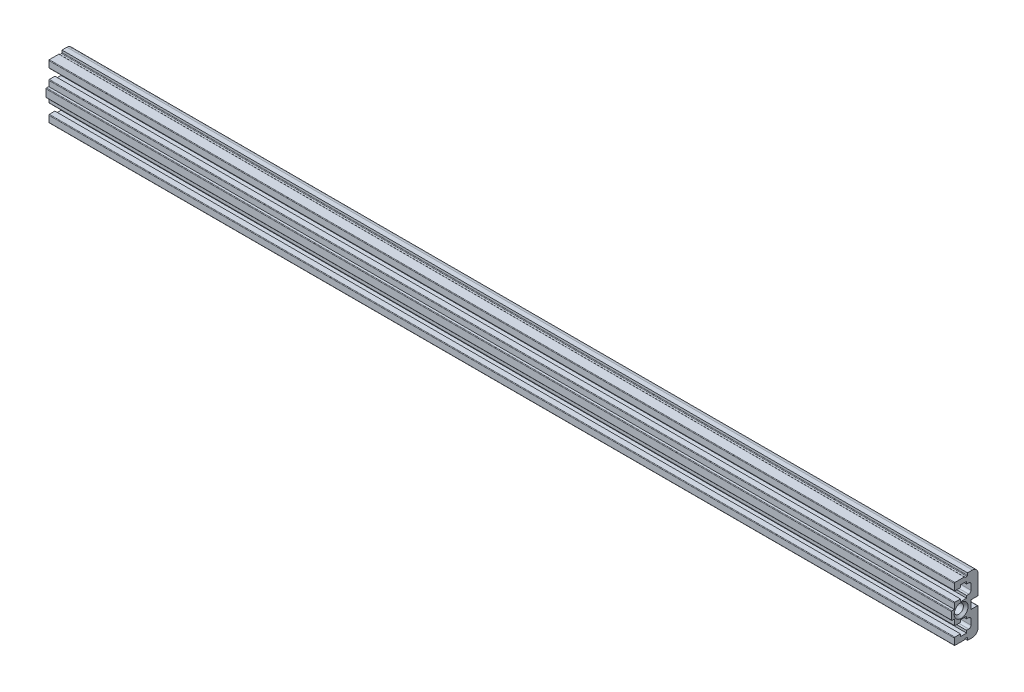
ISO-10303-21;
HEADER;
FILE_DESCRIPTION(('STEP AP214'),'2;1');
FILE_NAME('part.step','',(''),(''),'','','');
FILE_SCHEMA(('AUTOMOTIVE_DESIGN { 1 0 10303 214 1 1 1 1 }'));
ENDSEC;
DATA;
#1=APPLICATION_CONTEXT('core data for automotive mechanical design processes');
#2=APPLICATION_PROTOCOL_DEFINITION('international standard','automotive_design',2000,#1);
#3=PRODUCT_CONTEXT('',#1,'mechanical');
#4=PRODUCT('Part','Part','',(#3));
#5=PRODUCT_RELATED_PRODUCT_CATEGORY('part','',(#4));
#6=PRODUCT_DEFINITION_FORMATION('','',#4);
#7=PRODUCT_DEFINITION_CONTEXT('part definition',#1,'design');
#8=PRODUCT_DEFINITION('design','',#6,#7);
#9=PRODUCT_DEFINITION_SHAPE('','',#8);
#10=(LENGTH_UNIT() NAMED_UNIT(*) SI_UNIT(.MILLI.,.METRE.));
#11=(NAMED_UNIT(*) PLANE_ANGLE_UNIT() SI_UNIT($,.RADIAN.));
#12=(NAMED_UNIT(*) SI_UNIT($,.STERADIAN.) SOLID_ANGLE_UNIT());
#13=UNCERTAINTY_MEASURE_WITH_UNIT(LENGTH_MEASURE(1.E-05),#10,'distance_accuracy_value','');
#14=(GEOMETRIC_REPRESENTATION_CONTEXT(3) GLOBAL_UNCERTAINTY_ASSIGNED_CONTEXT((#13)) GLOBAL_UNIT_ASSIGNED_CONTEXT((#10,
#11,#12)) REPRESENTATION_CONTEXT('',''));
#15=CARTESIAN_POINT('',(0.,0.,0.));
#16=DIRECTION('',(0.,0.,1.));
#17=DIRECTION('',(1.,0.,0.));
#18=AXIS2_PLACEMENT_3D('',#15,#16,#17);
#19=CARTESIAN_POINT('',(215.9,-9.9,14.8));
#20=DIRECTION('',(1.,0.,0.));
#21=DIRECTION('',(0.,0.,-1.));
#22=AXIS2_PLACEMENT_3D('',#19,#20,#21);
#23=CYLINDRICAL_SURFACE('',#22,1.25);
#24=CARTESIAN_POINT('',(200.659655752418,-9.9,14.8));
#25=DIRECTION('',(1.,0.,0.));
#26=DIRECTION('',(0.,0.,-1.));
#27=AXIS2_PLACEMENT_3D('',#24,#25,#26);
#28=CIRCLE('',#27,1.25000000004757);
#29=CARTESIAN_POINT('',(200.659655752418,-9.9,13.5499999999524));
#30=VERTEX_POINT('',#29);
#31=EDGE_CURVE('E556',#30,#30,#28,.T.);
#32=ORIENTED_EDGE('',*,*,#31,.T.);
#33=EDGE_LOOP('',(#32));
#34=FACE_BOUND('',#33,.T.);
#35=CARTESIAN_POINT('',(-94.2,-9.9,14.8));
#36=DIRECTION('',(-1.,0.,0.));
#37=DIRECTION('',(0.,0.,1.));
#38=AXIS2_PLACEMENT_3D('',#35,#36,#37);
#39=CIRCLE('',#38,1.25);
#40=CARTESIAN_POINT('',(-94.2,-9.9,16.05));
#41=VERTEX_POINT('',#40);
#42=EDGE_CURVE('E625',#41,#41,#39,.F.);
#43=ORIENTED_EDGE('',*,*,#42,.F.);
#44=EDGE_LOOP('',(#43));
#45=FACE_BOUND('',#44,.T.);
#46=ADVANCED_FACE('F38',(#34,#45),#23,.F.);
#47=CARTESIAN_POINT('',(-215.9,-19.4,12.5));
#48=DIRECTION('',(0.,1.,0.));
#49=DIRECTION('',(0.,0.,1.));
#50=AXIS2_PLACEMENT_3D('',#47,#48,#49);
#51=PLANE('',#50);
#52=DIRECTION('',(1.,0.,0.));
#53=VECTOR('',#52,1.);
#54=CARTESIAN_POINT('',(-215.9,-19.4,13.3));
#55=LINE('',#54,#53);
#56=CARTESIAN_POINT('',(215.9,-19.4,13.3));
#57=VERTEX_POINT('',#56);
#58=CARTESIAN_POINT('',(-109.22,-19.4,13.3));
#59=VERTEX_POINT('',#58);
#60=EDGE_CURVE('E378',#57,#59,#55,.F.);
#61=ORIENTED_EDGE('',*,*,#60,.T.);
#62=DIRECTION('',(0.,0.,-1.));
#63=VECTOR('',#62,1.);
#64=CARTESIAN_POINT('',(-109.22,-19.4,12.5));
#65=LINE('',#64,#63);
#66=CARTESIAN_POINT('',(-109.22,-19.4,12.7));
#67=VERTEX_POINT('',#66);
#68=EDGE_CURVE('E766',#59,#67,#65,.T.);
#69=ORIENTED_EDGE('',*,*,#68,.T.);
#70=DIRECTION('',(1.,0.,0.));
#71=VECTOR('',#70,1.);
#72=CARTESIAN_POINT('',(-215.9,-19.4,12.7));
#73=LINE('',#72,#71);
#74=CARTESIAN_POINT('',(215.9,-19.4,12.7));
#75=VERTEX_POINT('',#74);
#76=EDGE_CURVE('E374',#67,#75,#73,.T.);
#77=ORIENTED_EDGE('',*,*,#76,.T.);
#78=DIRECTION('',(0.,0.,1.));
#79=VECTOR('',#78,1.);
#80=CARTESIAN_POINT('',(215.9,-19.4,12.5));
#81=LINE('',#80,#79);
#82=EDGE_CURVE('E203',#57,#75,#81,.F.);
#83=ORIENTED_EDGE('',*,*,#82,.F.);
#84=EDGE_LOOP('',(#61,#69,#77,#83));
#85=FACE_BOUND('',#84,.T.);
#86=ADVANCED_FACE('F934',(#85),#51,.F.);
#87=CARTESIAN_POINT('',(-215.9,-0.400000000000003,12.5));
#88=DIRECTION('',(0.,-1.,0.));
#89=DIRECTION('',(0.,0.,-1.));
#90=AXIS2_PLACEMENT_3D('',#87,#88,#89);
#91=PLANE('',#90);
#92=DIRECTION('',(1.,0.,0.));
#93=VECTOR('',#92,1.);
#94=CARTESIAN_POINT('',(-215.9,-0.400000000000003,12.7));
#95=LINE('',#94,#93);
#96=CARTESIAN_POINT('',(215.9,-0.400000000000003,12.7));
#97=VERTEX_POINT('',#96);
#98=CARTESIAN_POINT('',(-109.22,-0.400000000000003,12.7));
#99=VERTEX_POINT('',#98);
#100=EDGE_CURVE('E370',#97,#99,#95,.F.);
#101=ORIENTED_EDGE('',*,*,#100,.T.);
#102=DIRECTION('',(0.,0.,1.));
#103=VECTOR('',#102,1.);
#104=CARTESIAN_POINT('',(-109.22,-0.400000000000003,12.5));
#105=LINE('',#104,#103);
#106=CARTESIAN_POINT('',(-109.22,-0.400000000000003,13.3));
#107=VERTEX_POINT('',#106);
#108=EDGE_CURVE('E1070',#99,#107,#105,.T.);
#109=ORIENTED_EDGE('',*,*,#108,.T.);
#110=DIRECTION('',(1.,0.,0.));
#111=VECTOR('',#110,1.);
#112=CARTESIAN_POINT('',(-215.9,-0.400000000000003,13.3));
#113=LINE('',#112,#111);
#114=CARTESIAN_POINT('',(215.9,-0.400000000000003,13.3));
#115=VERTEX_POINT('',#114);
#116=EDGE_CURVE('E366',#107,#115,#113,.T.);
#117=ORIENTED_EDGE('',*,*,#116,.T.);
#118=DIRECTION('',(0.,0.,-1.));
#119=VECTOR('',#118,1.);
#120=CARTESIAN_POINT('',(215.9,-0.400000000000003,12.5));
#121=LINE('',#120,#119);
#122=EDGE_CURVE('E640',#97,#115,#121,.F.);
#123=ORIENTED_EDGE('',*,*,#122,.F.);
#124=EDGE_LOOP('',(#101,#109,#117,#123));
#125=FACE_BOUND('',#124,.T.);
#126=ADVANCED_FACE('F1113',(#125),#91,.F.);
#127=CARTESIAN_POINT('',(-215.9,-19.6,13.3));
#128=DIRECTION('',(1.,0.,0.));
#129=DIRECTION('',(0.,0.,-1.));
#130=AXIS2_PLACEMENT_3D('',#127,#128,#129);
#131=CYLINDRICAL_SURFACE('',#130,0.2);
#132=DIRECTION('',(1.,0.,0.));
#133=VECTOR('',#132,1.);
#134=CARTESIAN_POINT('',(-215.9,-19.55,13.4936491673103));
#135=LINE('',#134,#133);
#136=CARTESIAN_POINT('',(-109.22,-19.55,13.4936491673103));
#137=VERTEX_POINT('',#136);
#138=CARTESIAN_POINT('',(215.9,-19.55,13.4936491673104));
#139=VERTEX_POINT('',#138);
#140=EDGE_CURVE('E361',#137,#139,#135,.T.);
#141=ORIENTED_EDGE('',*,*,#140,.F.);
#142=CARTESIAN_POINT('',(-109.22,-19.6,13.3));
#143=DIRECTION('',(1.,0.,0.));
#144=DIRECTION('',(0.,0.,-1.));
#145=AXIS2_PLACEMENT_3D('',#142,#143,#144);
#146=CIRCLE('',#145,0.2);
#147=EDGE_CURVE('E771',#137,#59,#146,.F.);
#148=ORIENTED_EDGE('',*,*,#147,.T.);
#149=ORIENTED_EDGE('',*,*,#60,.F.);
#150=CARTESIAN_POINT('',(215.9,-19.6,13.3));
#151=DIRECTION('',(1.,0.,0.));
#152=DIRECTION('',(0.,0.,-1.));
#153=AXIS2_PLACEMENT_3D('',#150,#151,#152);
#154=CIRCLE('',#153,0.2);
#155=EDGE_CURVE('E375',#139,#57,#154,.F.);
#156=ORIENTED_EDGE('',*,*,#155,.F.);
#157=EDGE_LOOP('',(#141,#148,#149,#156));
#158=FACE_BOUND('',#157,.T.);
#159=ADVANCED_FACE('F928',(#158),#131,.F.);
#160=CARTESIAN_POINT('',(-215.9,-19.6,12.7));
#161=DIRECTION('',(1.,0.,0.));
#162=DIRECTION('',(0.,0.,-1.));
#163=AXIS2_PLACEMENT_3D('',#160,#161,#162);
#164=CYLINDRICAL_SURFACE('',#163,0.2);
#165=ORIENTED_EDGE('',*,*,#76,.F.);
#166=CARTESIAN_POINT('',(-109.22,-19.6,12.7));
#167=DIRECTION('',(1.,0.,0.));
#168=DIRECTION('',(0.,0.,-1.));
#169=AXIS2_PLACEMENT_3D('',#166,#167,#168);
#170=CIRCLE('',#169,0.2);
#171=CARTESIAN_POINT('',(-109.22,-19.6,12.5));
#172=VERTEX_POINT('',#171);
#173=EDGE_CURVE('E777',#67,#172,#170,.F.);
#174=ORIENTED_EDGE('',*,*,#173,.T.);
#175=DIRECTION('',(-1.,0.,0.));
#176=VECTOR('',#175,1.);
#177=CARTESIAN_POINT('',(-215.9,-19.6,12.5));
#178=LINE('',#177,#176);
#179=CARTESIAN_POINT('',(215.9,-19.6,12.5));
#180=VERTEX_POINT('',#179);
#181=EDGE_CURVE('E360',#172,#180,#178,.F.);
#182=ORIENTED_EDGE('',*,*,#181,.T.);
#183=CARTESIAN_POINT('',(215.9,-19.6,12.7));
#184=DIRECTION('',(1.,0.,0.));
#185=DIRECTION('',(0.,0.,-1.));
#186=AXIS2_PLACEMENT_3D('',#183,#184,#185);
#187=CIRCLE('',#186,0.2);
#188=EDGE_CURVE('E371',#75,#180,#187,.F.);
#189=ORIENTED_EDGE('',*,*,#188,.F.);
#190=EDGE_LOOP('',(#165,#174,#182,#189));
#191=FACE_BOUND('',#190,.T.);
#192=ADVANCED_FACE('F940',(#191),#164,.F.);
#193=CARTESIAN_POINT('',(-215.9,-0.200000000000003,12.7));
#194=DIRECTION('',(1.,0.,0.));
#195=DIRECTION('',(0.,0.,-1.));
#196=AXIS2_PLACEMENT_3D('',#193,#194,#195);
#197=CYLINDRICAL_SURFACE('',#196,0.2);
#198=DIRECTION('',(1.,0.,0.));
#199=VECTOR('',#198,1.);
#200=CARTESIAN_POINT('',(-215.9,-0.200000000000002,12.5));
#201=LINE('',#200,#199);
#202=CARTESIAN_POINT('',(215.9,-0.200000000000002,12.5));
#203=VERTEX_POINT('',#202);
#204=CARTESIAN_POINT('',(-109.22,-0.200000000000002,12.5));
#205=VERTEX_POINT('',#204);
#206=EDGE_CURVE('E353',#203,#205,#201,.F.);
#207=ORIENTED_EDGE('',*,*,#206,.T.);
#208=CARTESIAN_POINT('',(-109.22,-0.200000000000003,12.7));
#209=DIRECTION('',(1.,0.,0.));
#210=DIRECTION('',(0.,0.,-1.));
#211=AXIS2_PLACEMENT_3D('',#208,#209,#210);
#212=CIRCLE('',#211,0.2);
#213=EDGE_CURVE('E1073',#205,#99,#212,.F.);
#214=ORIENTED_EDGE('',*,*,#213,.T.);
#215=ORIENTED_EDGE('',*,*,#100,.F.);
#216=CARTESIAN_POINT('',(215.9,-0.200000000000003,12.7));
#217=DIRECTION('',(1.,0.,0.));
#218=DIRECTION('',(0.,0.,-1.));
#219=AXIS2_PLACEMENT_3D('',#216,#217,#218);
#220=CIRCLE('',#219,0.2);
#221=EDGE_CURVE('E367',#203,#97,#220,.F.);
#222=ORIENTED_EDGE('',*,*,#221,.F.);
#223=EDGE_LOOP('',(#207,#214,#215,#222));
#224=FACE_BOUND('',#223,.T.);
#225=ADVANCED_FACE('F1324',(#224),#197,.F.);
#226=CARTESIAN_POINT('',(-215.9,-0.200000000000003,13.3));
#227=DIRECTION('',(1.,0.,0.));
#228=DIRECTION('',(0.,0.,-1.));
#229=AXIS2_PLACEMENT_3D('',#226,#227,#228);
#230=CYLINDRICAL_SURFACE('',#229,0.2);
#231=ORIENTED_EDGE('',*,*,#116,.F.);
#232=CARTESIAN_POINT('',(-109.22,-0.200000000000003,13.3));
#233=DIRECTION('',(1.,0.,0.));
#234=DIRECTION('',(0.,0.,-1.));
#235=AXIS2_PLACEMENT_3D('',#232,#233,#234);
#236=CIRCLE('',#235,0.2);
#237=CARTESIAN_POINT('',(-109.22,-0.250000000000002,13.4936491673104));
#238=VERTEX_POINT('',#237);
#239=EDGE_CURVE('E1067',#107,#238,#236,.F.);
#240=ORIENTED_EDGE('',*,*,#239,.T.);
#241=DIRECTION('',(1.,0.,0.));
#242=VECTOR('',#241,1.);
#243=CARTESIAN_POINT('',(-215.9,-0.249999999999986,13.4936491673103));
#244=LINE('',#243,#242);
#245=CARTESIAN_POINT('',(215.9,-0.249999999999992,13.4936491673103));
#246=VERTEX_POINT('',#245);
#247=EDGE_CURVE('E350',#246,#238,#244,.F.);
#248=ORIENTED_EDGE('',*,*,#247,.F.);
#249=CARTESIAN_POINT('',(215.9,-0.200000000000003,13.3));
#250=DIRECTION('',(1.,0.,0.));
#251=DIRECTION('',(0.,0.,-1.));
#252=AXIS2_PLACEMENT_3D('',#249,#250,#251);
#253=CIRCLE('',#252,0.2);
#254=EDGE_CURVE('E362',#115,#246,#253,.F.);
#255=ORIENTED_EDGE('',*,*,#254,.F.);
#256=EDGE_LOOP('',(#231,#240,#248,#255));
#257=FACE_BOUND('',#256,.T.);
#258=ADVANCED_FACE('F1320',(#257),#230,.F.);
#259=CARTESIAN_POINT('',(-215.9,-2.7,12.85));
#260=DIRECTION('',(0.,1.,0.));
#261=DIRECTION('',(0.,0.,1.));
#262=AXIS2_PLACEMENT_3D('',#259,#260,#261);
#263=PLANE('',#262);
#264=DIRECTION('',(1.,0.,0.));
#265=VECTOR('',#264,1.);
#266=CARTESIAN_POINT('',(-215.9,-2.7,12.85));
#267=LINE('',#266,#265);
#268=CARTESIAN_POINT('',(215.9,-2.7,12.85));
#269=VERTEX_POINT('',#268);
#270=CARTESIAN_POINT('',(-109.22,-2.7,12.85));
#271=VERTEX_POINT('',#270);
#272=EDGE_CURVE('E347',#269,#271,#267,.F.);
#273=ORIENTED_EDGE('',*,*,#272,.T.);
#274=DIRECTION('',(0.,0.,-1.));
#275=VECTOR('',#274,1.);
#276=CARTESIAN_POINT('',(-109.22,-2.7,12.85));
#277=LINE('',#276,#275);
#278=CARTESIAN_POINT('',(-109.22,-2.7,12.05));
#279=VERTEX_POINT('',#278);
#280=EDGE_CURVE('E1037',#271,#279,#277,.T.);
#281=ORIENTED_EDGE('',*,*,#280,.T.);
#282=DIRECTION('',(1.,0.,0.));
#283=VECTOR('',#282,1.);
#284=CARTESIAN_POINT('',(-215.9,-2.7,12.05));
#285=LINE('',#284,#283);
#286=CARTESIAN_POINT('',(215.9,-2.7,12.05));
#287=VERTEX_POINT('',#286);
#288=EDGE_CURVE('E344',#279,#287,#285,.T.);
#289=ORIENTED_EDGE('',*,*,#288,.T.);
#290=DIRECTION('',(0.,0.,1.));
#291=VECTOR('',#290,1.);
#292=CARTESIAN_POINT('',(215.9,-2.7,12.85));
#293=LINE('',#292,#291);
#294=EDGE_CURVE('E365',#269,#287,#293,.F.);
#295=ORIENTED_EDGE('',*,*,#294,.F.);
#296=EDGE_LOOP('',(#273,#281,#289,#295));
#297=FACE_BOUND('',#296,.T.);
#298=ADVANCED_FACE('F1317',(#297),#263,.F.);
#299=CARTESIAN_POINT('',(-215.9,-6.25,12.85));
#300=DIRECTION('',(0.,-1.,0.));
#301=DIRECTION('',(0.,0.,-1.));
#302=AXIS2_PLACEMENT_3D('',#299,#300,#301);
#303=PLANE('',#302);
#304=DIRECTION('',(1.,0.,0.));
#305=VECTOR('',#304,1.);
#306=CARTESIAN_POINT('',(-215.9,-6.25,12.05));
#307=LINE('',#306,#305);
#308=CARTESIAN_POINT('',(215.9,-6.25,12.05));
#309=VERTEX_POINT('',#308);
#310=CARTESIAN_POINT('',(-109.22,-6.25,12.05));
#311=VERTEX_POINT('',#310);
#312=EDGE_CURVE('E340',#309,#311,#307,.F.);
#313=ORIENTED_EDGE('',*,*,#312,.T.);
#314=DIRECTION('',(0.,0.,1.));
#315=VECTOR('',#314,1.);
#316=CARTESIAN_POINT('',(-109.22,-6.25,12.85));
#317=LINE('',#316,#315);
#318=CARTESIAN_POINT('',(-109.22,-6.25,12.85));
#319=VERTEX_POINT('',#318);
#320=EDGE_CURVE('E894',#311,#319,#317,.T.);
#321=ORIENTED_EDGE('',*,*,#320,.T.);
#322=DIRECTION('',(1.,0.,0.));
#323=VECTOR('',#322,1.);
#324=CARTESIAN_POINT('',(-215.9,-6.25,12.85));
#325=LINE('',#324,#323);
#326=CARTESIAN_POINT('',(215.9,-6.25,12.85));
#327=VERTEX_POINT('',#326);
#328=EDGE_CURVE('E590',#319,#327,#325,.T.);
#329=ORIENTED_EDGE('',*,*,#328,.T.);
#330=DIRECTION('',(0.,0.,-1.));
#331=VECTOR('',#330,1.);
#332=CARTESIAN_POINT('',(215.9,-6.25,12.85));
#333=LINE('',#332,#331);
#334=EDGE_CURVE('E563',#309,#327,#333,.F.);
#335=ORIENTED_EDGE('',*,*,#334,.F.);
#336=EDGE_LOOP('',(#313,#321,#329,#335));
#337=FACE_BOUND('',#336,.T.);
#338=ADVANCED_FACE('F1026',(#337),#303,.F.);
#339=CARTESIAN_POINT('',(-215.9,-13.55,12.85));
#340=DIRECTION('',(0.,1.,0.));
#341=DIRECTION('',(0.,0.,1.));
#342=AXIS2_PLACEMENT_3D('',#339,#340,#341);
#343=PLANE('',#342);
#344=DIRECTION('',(1.,0.,0.));
#345=VECTOR('',#344,1.);
#346=CARTESIAN_POINT('',(-215.9,-13.55,12.85));
#347=LINE('',#346,#345);
#348=CARTESIAN_POINT('',(215.9,-13.55,12.85));
#349=VERTEX_POINT('',#348);
#350=CARTESIAN_POINT('',(-109.22,-13.55,12.85));
#351=VERTEX_POINT('',#350);
#352=EDGE_CURVE('E326',#349,#351,#347,.F.);
#353=ORIENTED_EDGE('',*,*,#352,.T.);
#354=DIRECTION('',(0.,0.,-1.));
#355=VECTOR('',#354,1.);
#356=CARTESIAN_POINT('',(-109.22,-13.55,12.85));
#357=LINE('',#356,#355);
#358=CARTESIAN_POINT('',(-109.22,-13.55,12.05));
#359=VERTEX_POINT('',#358);
#360=EDGE_CURVE('E795',#351,#359,#357,.T.);
#361=ORIENTED_EDGE('',*,*,#360,.T.);
#362=DIRECTION('',(1.,0.,0.));
#363=VECTOR('',#362,1.);
#364=CARTESIAN_POINT('',(-215.9,-13.55,12.05));
#365=LINE('',#364,#363);
#366=CARTESIAN_POINT('',(215.9,-13.55,12.05));
#367=VERTEX_POINT('',#366);
#368=EDGE_CURVE('E323',#359,#367,#365,.T.);
#369=ORIENTED_EDGE('',*,*,#368,.T.);
#370=DIRECTION('',(0.,0.,1.));
#371=VECTOR('',#370,1.);
#372=CARTESIAN_POINT('',(215.9,-13.55,12.85));
#373=LINE('',#372,#371);
#374=EDGE_CURVE('E557',#349,#367,#373,.F.);
#375=ORIENTED_EDGE('',*,*,#374,.F.);
#376=EDGE_LOOP('',(#353,#361,#369,#375));
#377=FACE_BOUND('',#376,.T.);
#378=ADVANCED_FACE('F1310',(#377),#343,.F.);
#379=CARTESIAN_POINT('',(-215.9,-17.1,12.85));
#380=DIRECTION('',(0.,-1.,0.));
#381=DIRECTION('',(0.,0.,-1.));
#382=AXIS2_PLACEMENT_3D('',#379,#380,#381);
#383=PLANE('',#382);
#384=DIRECTION('',(1.,0.,0.));
#385=VECTOR('',#384,1.);
#386=CARTESIAN_POINT('',(-215.9,-17.1,12.05));
#387=LINE('',#386,#385);
#388=CARTESIAN_POINT('',(215.9,-17.1,12.05));
#389=VERTEX_POINT('',#388);
#390=CARTESIAN_POINT('',(-109.22,-17.1,12.05));
#391=VERTEX_POINT('',#390);
#392=EDGE_CURVE('E319',#389,#391,#387,.F.);
#393=ORIENTED_EDGE('',*,*,#392,.T.);
#394=DIRECTION('',(0.,0.,1.));
#395=VECTOR('',#394,1.);
#396=CARTESIAN_POINT('',(-109.22,-17.1,12.85));
#397=LINE('',#396,#395);
#398=CARTESIAN_POINT('',(-109.22,-17.1,12.85));
#399=VERTEX_POINT('',#398);
#400=EDGE_CURVE('E768',#391,#399,#397,.T.);
#401=ORIENTED_EDGE('',*,*,#400,.T.);
#402=DIRECTION('',(1.,0.,0.));
#403=VECTOR('',#402,1.);
#404=CARTESIAN_POINT('',(-215.9,-17.1,12.85));
#405=LINE('',#404,#403);
#406=CARTESIAN_POINT('',(215.9,-17.1,12.85));
#407=VERTEX_POINT('',#406);
#408=EDGE_CURVE('E552',#399,#407,#405,.T.);
#409=ORIENTED_EDGE('',*,*,#408,.T.);
#410=DIRECTION('',(0.,0.,-1.));
#411=VECTOR('',#410,1.);
#412=CARTESIAN_POINT('',(215.9,-17.1,12.85));
#413=LINE('',#412,#411);
#414=EDGE_CURVE('E553',#389,#407,#413,.F.);
#415=ORIENTED_EDGE('',*,*,#414,.F.);
#416=EDGE_LOOP('',(#393,#401,#409,#415));
#417=FACE_BOUND('',#416,.T.);
#418=ADVANCED_FACE('F1306',(#417),#383,.F.);
#419=CARTESIAN_POINT('',(200.89999999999,-9.9,14.8));
#420=DIRECTION('',(1.,0.,0.));
#421=DIRECTION('',(0.,0.,-1.));
#422=AXIS2_PLACEMENT_3D('',#419,#420,#421);
#423=CONICAL_SURFACE('',#422,1.64999999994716,1.02974425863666);
#424=CARTESIAN_POINT('',(200.9,-9.9,14.8));
#425=DIRECTION('',(-1.,0.,0.));
#426=DIRECTION('',(0.,0.,1.));
#427=AXIS2_PLACEMENT_3D('',#424,#425,#426);
#428=CIRCLE('',#427,1.65);
#429=CARTESIAN_POINT('',(200.9,-9.9,16.45));
#430=VERTEX_POINT('',#429);
#431=EDGE_CURVE('E312',#430,#430,#428,.F.);
#432=ORIENTED_EDGE('',*,*,#431,.T.);
#433=EDGE_LOOP('',(#432));
#434=FACE_BOUND('',#433,.T.);
#435=ORIENTED_EDGE('',*,*,#31,.F.);
#436=EDGE_LOOP('',(#435));
#437=FACE_BOUND('',#436,.T.);
#438=ADVANCED_FACE('F1302',(#434,#437),#423,.F.);
#439=CARTESIAN_POINT('',(-215.9,-19.5,13.6872983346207));
#440=DIRECTION('',(1.,0.,0.));
#441=DIRECTION('',(0.,0.,-1.));
#442=AXIS2_PLACEMENT_3D('',#439,#440,#441);
#443=CYLINDRICAL_SURFACE('',#442,0.2);
#444=CARTESIAN_POINT('',(-109.22,-19.5,13.6872983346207));
#445=DIRECTION('',(1.,0.,0.));
#446=DIRECTION('',(0.,0.,-1.));
#447=AXIS2_PLACEMENT_3D('',#444,#445,#446);
#448=CIRCLE('',#447,0.2);
#449=CARTESIAN_POINT('',(-109.22,-19.7,13.6872983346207));
#450=VERTEX_POINT('',#449);
#451=EDGE_CURVE('E921',#137,#450,#448,.F.);
#452=ORIENTED_EDGE('',*,*,#451,.F.);
#453=ORIENTED_EDGE('',*,*,#140,.T.);
#454=CARTESIAN_POINT('',(215.9,-19.5,13.6872983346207));
#455=DIRECTION('',(1.,0.,0.));
#456=DIRECTION('',(0.,0.,-1.));
#457=AXIS2_PLACEMENT_3D('',#454,#455,#456);
#458=CIRCLE('',#457,0.2);
#459=CARTESIAN_POINT('',(215.9,-19.7,13.6872983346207));
#460=VERTEX_POINT('',#459);
#461=EDGE_CURVE('E358',#139,#460,#458,.F.);
#462=ORIENTED_EDGE('',*,*,#461,.T.);
#463=DIRECTION('',(1.,0.,0.));
#464=VECTOR('',#463,1.);
#465=CARTESIAN_POINT('',(-215.9,-19.7,13.6872983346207));
#466=LINE('',#465,#464);
#467=EDGE_CURVE('E493',#460,#450,#466,.F.);
#468=ORIENTED_EDGE('',*,*,#467,.T.);
#469=EDGE_LOOP('',(#452,#453,#462,#468));
#470=FACE_BOUND('',#469,.T.);
#471=ADVANCED_FACE('F1299',(#470),#443,.T.);
#472=CARTESIAN_POINT('',(-215.9,-19.7,12.5));
#473=DIRECTION('',(0.,0.,-1.));
#474=DIRECTION('',(-1.,0.,0.));
#475=AXIS2_PLACEMENT_3D('',#472,#473,#474);
#476=PLANE('',#475);
#477=ORIENTED_EDGE('',*,*,#181,.F.);
#478=DIRECTION('',(0.,-1.,0.));
#479=VECTOR('',#478,1.);
#480=CARTESIAN_POINT('',(-109.22,-19.7,12.5));
#481=LINE('',#480,#479);
#482=CARTESIAN_POINT('',(-109.22,-20.4,12.5));
#483=VERTEX_POINT('',#482);
#484=EDGE_CURVE('E783',#172,#483,#481,.T.);
#485=ORIENTED_EDGE('',*,*,#484,.T.);
#486=DIRECTION('',(1.,0.,0.));
#487=VECTOR('',#486,1.);
#488=CARTESIAN_POINT('',(215.9,-20.4,12.5));
#489=LINE('',#488,#487);
#490=CARTESIAN_POINT('',(215.9,-20.4,12.5));
#491=VERTEX_POINT('',#490);
#492=EDGE_CURVE('E475',#483,#491,#489,.T.);
#493=ORIENTED_EDGE('',*,*,#492,.T.);
#494=DIRECTION('',(0.,1.,0.));
#495=VECTOR('',#494,1.);
#496=CARTESIAN_POINT('',(215.9,-19.7,12.5));
#497=LINE('',#496,#495);
#498=EDGE_CURVE('E357',#180,#491,#497,.F.);
#499=ORIENTED_EDGE('',*,*,#498,.F.);
#500=EDGE_LOOP('',(#477,#485,#493,#499));
#501=FACE_BOUND('',#500,.T.);
#502=ADVANCED_FACE('F946',(#501),#476,.F.);
#503=CARTESIAN_POINT('',(215.9,-11.6,8.95));
#504=DIRECTION('',(1.,0.,0.));
#505=DIRECTION('',(0.,0.,-1.));
#506=AXIS2_PLACEMENT_3D('',#503,#504,#505);
#507=CYLINDRICAL_SURFACE('',#506,0.2);
#508=CARTESIAN_POINT('',(-109.22,-11.6,8.95));
#509=DIRECTION('',(1.,0.,0.));
#510=DIRECTION('',(0.,0.,-1.));
#511=AXIS2_PLACEMENT_3D('',#508,#509,#510);
#512=CIRCLE('',#511,0.2);
#513=CARTESIAN_POINT('',(-109.22,-11.4,8.95));
#514=VERTEX_POINT('',#513);
#515=CARTESIAN_POINT('',(-109.22,-11.6,8.75));
#516=VERTEX_POINT('',#515);
#517=EDGE_CURVE('E1083',#514,#516,#512,.F.);
#518=ORIENTED_EDGE('',*,*,#517,.F.);
#519=DIRECTION('',(1.,0.,0.));
#520=VECTOR('',#519,1.);
#521=CARTESIAN_POINT('',(215.9,-11.4,8.95));
#522=LINE('',#521,#520);
#523=CARTESIAN_POINT('',(215.9,-11.4,8.95));
#524=VERTEX_POINT('',#523);
#525=EDGE_CURVE('E474',#514,#524,#522,.T.);
#526=ORIENTED_EDGE('',*,*,#525,.T.);
#527=CARTESIAN_POINT('',(215.9,-11.6,8.95));
#528=DIRECTION('',(1.,0.,0.));
#529=DIRECTION('',(0.,0.,-1.));
#530=AXIS2_PLACEMENT_3D('',#527,#528,#529);
#531=CIRCLE('',#530,0.2);
#532=CARTESIAN_POINT('',(215.9,-11.6,8.75));
#533=VERTEX_POINT('',#532);
#534=EDGE_CURVE('E354',#524,#533,#531,.F.);
#535=ORIENTED_EDGE('',*,*,#534,.T.);
#536=DIRECTION('',(1.,0.,0.));
#537=VECTOR('',#536,1.);
#538=CARTESIAN_POINT('',(215.9,-11.6,8.75));
#539=LINE('',#538,#537);
#540=EDGE_CURVE('E482',#533,#516,#539,.F.);
#541=ORIENTED_EDGE('',*,*,#540,.T.);
#542=EDGE_LOOP('',(#518,#526,#535,#541));
#543=FACE_BOUND('',#542,.T.);
#544=ADVANCED_FACE('F1292',(#543),#507,.T.);
#545=CARTESIAN_POINT('',(-215.9,-0.100000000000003,12.5));
#546=DIRECTION('',(0.,0.,-1.));
#547=DIRECTION('',(0.,1.,0.));
#548=AXIS2_PLACEMENT_3D('',#545,#546,#547);
#549=PLANE('',#548);
#550=DIRECTION('',(1.,0.,0.));
#551=VECTOR('',#550,1.);
#552=CARTESIAN_POINT('',(215.9,0.599999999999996,12.5));
#553=LINE('',#552,#551);
#554=CARTESIAN_POINT('',(215.9,0.599999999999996,12.5));
#555=VERTEX_POINT('',#554);
#556=CARTESIAN_POINT('',(-109.22,0.599999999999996,12.5));
#557=VERTEX_POINT('',#556);
#558=EDGE_CURVE('E457',#555,#557,#553,.F.);
#559=ORIENTED_EDGE('',*,*,#558,.T.);
#560=DIRECTION('',(0.,-1.,0.));
#561=VECTOR('',#560,1.);
#562=CARTESIAN_POINT('',(-109.22,-0.100000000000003,12.5));
#563=LINE('',#562,#561);
#564=EDGE_CURVE('E1076',#557,#205,#563,.T.);
#565=ORIENTED_EDGE('',*,*,#564,.T.);
#566=ORIENTED_EDGE('',*,*,#206,.F.);
#567=DIRECTION('',(0.,1.,0.));
#568=VECTOR('',#567,1.);
#569=CARTESIAN_POINT('',(215.9,-0.100000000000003,12.5));
#570=LINE('',#569,#568);
#571=EDGE_CURVE('E356',#555,#203,#570,.F.);
#572=ORIENTED_EDGE('',*,*,#571,.F.);
#573=EDGE_LOOP('',(#559,#565,#566,#572));
#574=FACE_BOUND('',#573,.T.);
#575=ADVANCED_FACE('F1288',(#574),#549,.F.);
#576=CARTESIAN_POINT('',(-215.9,-0.300000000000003,13.6872983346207));
#577=DIRECTION('',(1.,0.,0.));
#578=DIRECTION('',(0.,0.,-1.));
#579=AXIS2_PLACEMENT_3D('',#576,#577,#578);
#580=CYLINDRICAL_SURFACE('',#579,0.2);
#581=CARTESIAN_POINT('',(-109.22,-0.300000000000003,13.6872983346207));
#582=DIRECTION('',(1.,0.,0.));
#583=DIRECTION('',(0.,0.,-1.));
#584=AXIS2_PLACEMENT_3D('',#581,#582,#583);
#585=CIRCLE('',#584,0.2);
#586=CARTESIAN_POINT('',(-109.22,-0.100000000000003,13.6872983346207));
#587=VERTEX_POINT('',#586);
#588=EDGE_CURVE('E1064',#587,#238,#585,.F.);
#589=ORIENTED_EDGE('',*,*,#588,.F.);
#590=DIRECTION('',(1.,0.,0.));
#591=VECTOR('',#590,1.);
#592=CARTESIAN_POINT('',(-215.9,-0.100000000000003,13.6872983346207));
#593=LINE('',#592,#591);
#594=CARTESIAN_POINT('',(215.9,-0.100000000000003,13.6872983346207));
#595=VERTEX_POINT('',#594);
#596=EDGE_CURVE('E455',#587,#595,#593,.T.);
#597=ORIENTED_EDGE('',*,*,#596,.T.);
#598=CARTESIAN_POINT('',(215.9,-0.300000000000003,13.6872983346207));
#599=DIRECTION('',(1.,0.,0.));
#600=DIRECTION('',(0.,0.,-1.));
#601=AXIS2_PLACEMENT_3D('',#598,#599,#600);
#602=CIRCLE('',#601,0.2);
#603=EDGE_CURVE('E351',#595,#246,#602,.F.);
#604=ORIENTED_EDGE('',*,*,#603,.T.);
#605=ORIENTED_EDGE('',*,*,#247,.T.);
#606=EDGE_LOOP('',(#589,#597,#604,#605));
#607=FACE_BOUND('',#606,.T.);
#608=ADVANCED_FACE('F1284',(#607),#580,.T.);
#609=CARTESIAN_POINT('',(-215.9,-0.300000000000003,17.05));
#610=DIRECTION('',(-1.,0.,0.));
#611=DIRECTION('',(0.,0.,1.));
#612=AXIS2_PLACEMENT_3D('',#609,#610,#611);
#613=CYLINDRICAL_SURFACE('',#612,0.199999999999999);
#614=CARTESIAN_POINT('',(-109.22,-0.300000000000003,17.05));
#615=DIRECTION('',(1.,0.,0.));
#616=DIRECTION('',(0.,0.,-1.));
#617=AXIS2_PLACEMENT_3D('',#614,#615,#616);
#618=CIRCLE('',#617,0.199999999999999);
#619=CARTESIAN_POINT('',(-109.22,-0.300000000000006,17.25));
#620=VERTEX_POINT('',#619);
#621=CARTESIAN_POINT('',(-109.22,-0.100000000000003,17.05));
#622=VERTEX_POINT('',#621);
#623=EDGE_CURVE('E1058',#620,#622,#618,.F.);
#624=ORIENTED_EDGE('',*,*,#623,.F.);
#625=DIRECTION('',(1.,0.,0.));
#626=VECTOR('',#625,1.);
#627=CARTESIAN_POINT('',(215.9,-0.300000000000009,17.25));
#628=LINE('',#627,#626);
#629=CARTESIAN_POINT('',(215.9,-0.300000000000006,17.25));
#630=VERTEX_POINT('',#629);
#631=EDGE_CURVE('E450',#620,#630,#628,.T.);
#632=ORIENTED_EDGE('',*,*,#631,.T.);
#633=CARTESIAN_POINT('',(215.9,-0.300000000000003,17.05));
#634=DIRECTION('',(-1.,0.,0.));
#635=DIRECTION('',(0.,0.,1.));
#636=AXIS2_PLACEMENT_3D('',#633,#634,#635);
#637=CIRCLE('',#636,0.199999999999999);
#638=CARTESIAN_POINT('',(215.9,-0.100000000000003,17.05));
#639=VERTEX_POINT('',#638);
#640=EDGE_CURVE('E348',#630,#639,#637,.T.);
#641=ORIENTED_EDGE('',*,*,#640,.T.);
#642=DIRECTION('',(1.,0.,0.));
#643=VECTOR('',#642,1.);
#644=CARTESIAN_POINT('',(-215.9,-0.100000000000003,17.05));
#645=LINE('',#644,#643);
#646=EDGE_CURVE('E452',#639,#622,#645,.F.);
#647=ORIENTED_EDGE('',*,*,#646,.T.);
#648=EDGE_LOOP('',(#624,#632,#641,#647));
#649=FACE_BOUND('',#648,.T.);
#650=ADVANCED_FACE('F1280',(#649),#613,.T.);
#651=CARTESIAN_POINT('',(215.9,-2.5,17.05));
#652=DIRECTION('',(-1.,0.,0.));
#653=DIRECTION('',(0.,0.,1.));
#654=AXIS2_PLACEMENT_3D('',#651,#652,#653);
#655=CYLINDRICAL_SURFACE('',#654,0.199999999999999);
#656=CARTESIAN_POINT('',(-109.22,-2.5,17.05));
#657=DIRECTION('',(1.,0.,0.));
#658=DIRECTION('',(0.,0.,-1.));
#659=AXIS2_PLACEMENT_3D('',#656,#657,#658);
#660=CIRCLE('',#659,0.199999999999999);
#661=CARTESIAN_POINT('',(-109.22,-2.7,17.05));
#662=VERTEX_POINT('',#661);
#663=CARTESIAN_POINT('',(-109.22,-2.5,17.25));
#664=VERTEX_POINT('',#663);
#665=EDGE_CURVE('E1052',#662,#664,#660,.F.);
#666=ORIENTED_EDGE('',*,*,#665,.F.);
#667=DIRECTION('',(1.,0.,0.));
#668=VECTOR('',#667,1.);
#669=CARTESIAN_POINT('',(-215.9,-2.7,17.05));
#670=LINE('',#669,#668);
#671=CARTESIAN_POINT('',(215.9,-2.7,17.05));
#672=VERTEX_POINT('',#671);
#673=EDGE_CURVE('E442',#662,#672,#670,.T.);
#674=ORIENTED_EDGE('',*,*,#673,.T.);
#675=CARTESIAN_POINT('',(215.9,-2.5,17.05));
#676=DIRECTION('',(-1.,0.,0.));
#677=DIRECTION('',(0.,0.,1.));
#678=AXIS2_PLACEMENT_3D('',#675,#676,#677);
#679=CIRCLE('',#678,0.199999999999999);
#680=CARTESIAN_POINT('',(215.9,-2.5,17.25));
#681=VERTEX_POINT('',#680);
#682=EDGE_CURVE('E345',#672,#681,#679,.T.);
#683=ORIENTED_EDGE('',*,*,#682,.T.);
#684=DIRECTION('',(1.,0.,0.));
#685=VECTOR('',#684,1.);
#686=CARTESIAN_POINT('',(215.9,-2.50000000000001,17.25));
#687=LINE('',#686,#685);
#688=EDGE_CURVE('E447',#681,#664,#687,.F.);
#689=ORIENTED_EDGE('',*,*,#688,.T.);
#690=EDGE_LOOP('',(#666,#674,#683,#689));
#691=FACE_BOUND('',#690,.T.);
#692=ADVANCED_FACE('F1276',(#691),#655,.T.);
#693=CARTESIAN_POINT('',(-215.9,-1.85,12.85));
#694=DIRECTION('',(0.,0.,-1.));
#695=DIRECTION('',(0.,1.,0.));
#696=AXIS2_PLACEMENT_3D('',#693,#694,#695);
#697=PLANE('',#696);
#698=DIRECTION('',(1.,0.,0.));
#699=VECTOR('',#698,1.);
#700=CARTESIAN_POINT('',(-215.9,-1.85,12.85));
#701=LINE('',#700,#699);
#702=CARTESIAN_POINT('',(215.9,-1.85,12.85));
#703=VERTEX_POINT('',#702);
#704=CARTESIAN_POINT('',(-109.22,-1.85,12.85));
#705=VERTEX_POINT('',#704);
#706=EDGE_CURVE('E439',#703,#705,#701,.F.);
#707=ORIENTED_EDGE('',*,*,#706,.T.);
#708=DIRECTION('',(0.,-1.,0.));
#709=VECTOR('',#708,1.);
#710=CARTESIAN_POINT('',(-109.22,-1.85,12.85));
#711=LINE('',#710,#709);
#712=EDGE_CURVE('E1040',#705,#271,#711,.T.);
#713=ORIENTED_EDGE('',*,*,#712,.T.);
#714=ORIENTED_EDGE('',*,*,#272,.F.);
#715=DIRECTION('',(0.,1.,0.));
#716=VECTOR('',#715,1.);
#717=CARTESIAN_POINT('',(215.9,-1.85,12.85));
#718=LINE('',#717,#716);
#719=EDGE_CURVE('E526',#703,#269,#718,.F.);
#720=ORIENTED_EDGE('',*,*,#719,.F.);
#721=EDGE_LOOP('',(#707,#713,#714,#720));
#722=FACE_BOUND('',#721,.T.);
#723=ADVANCED_FACE('F1272',(#722),#697,.F.);
#724=CARTESIAN_POINT('',(-215.9,-1.85,15.05));
#725=DIRECTION('',(0.,0.,1.));
#726=DIRECTION('',(0.,-1.,0.));
#727=AXIS2_PLACEMENT_3D('',#724,#725,#726);
#728=PLANE('',#727);
#729=DIRECTION('',(1.,0.,0.));
#730=VECTOR('',#729,1.);
#731=CARTESIAN_POINT('',(-215.9,-2.7,15.05));
#732=LINE('',#731,#730);
#733=CARTESIAN_POINT('',(215.9,-2.7,15.05));
#734=VERTEX_POINT('',#733);
#735=CARTESIAN_POINT('',(-109.22,-2.7,15.05));
#736=VERTEX_POINT('',#735);
#737=EDGE_CURVE('E444',#734,#736,#732,.F.);
#738=ORIENTED_EDGE('',*,*,#737,.T.);
#739=DIRECTION('',(0.,1.,0.));
#740=VECTOR('',#739,1.);
#741=CARTESIAN_POINT('',(-109.22,-1.85,15.05));
#742=LINE('',#741,#740);
#743=CARTESIAN_POINT('',(-109.22,-1.85,15.05));
#744=VERTEX_POINT('',#743);
#745=EDGE_CURVE('E1046',#736,#744,#742,.T.);
#746=ORIENTED_EDGE('',*,*,#745,.T.);
#747=DIRECTION('',(1.,0.,0.));
#748=VECTOR('',#747,1.);
#749=CARTESIAN_POINT('',(-215.9,-1.85,15.05));
#750=LINE('',#749,#748);
#751=CARTESIAN_POINT('',(215.9,-1.85,15.05));
#752=VERTEX_POINT('',#751);
#753=EDGE_CURVE('E425',#744,#752,#750,.T.);
#754=ORIENTED_EDGE('',*,*,#753,.T.);
#755=DIRECTION('',(0.,-1.,0.));
#756=VECTOR('',#755,1.);
#757=CARTESIAN_POINT('',(215.9,-1.85,15.05));
#758=LINE('',#757,#756);
#759=EDGE_CURVE('E523',#734,#752,#758,.F.);
#760=ORIENTED_EDGE('',*,*,#759,.F.);
#761=EDGE_LOOP('',(#738,#746,#754,#760));
#762=FACE_BOUND('',#761,.T.);
#763=ADVANCED_FACE('F1268',(#762),#728,.F.);
#764=CARTESIAN_POINT('',(-215.9,-3.5,12.05));
#765=DIRECTION('',(1.,0.,0.));
#766=DIRECTION('',(0.,0.,-1.));
#767=AXIS2_PLACEMENT_3D('',#764,#765,#766);
#768=CYLINDRICAL_SURFACE('',#767,0.8);
#769=ORIENTED_EDGE('',*,*,#288,.F.);
#770=CARTESIAN_POINT('',(-109.22,-3.5,12.05));
#771=DIRECTION('',(1.,0.,0.));
#772=DIRECTION('',(0.,0.,-1.));
#773=AXIS2_PLACEMENT_3D('',#770,#771,#772);
#774=CIRCLE('',#773,0.8);
#775=CARTESIAN_POINT('',(-109.22,-3.5,11.25));
#776=VERTEX_POINT('',#775);
#777=EDGE_CURVE('E1034',#279,#776,#774,.F.);
#778=ORIENTED_EDGE('',*,*,#777,.T.);
#779=DIRECTION('',(-1.,0.,0.));
#780=VECTOR('',#779,1.);
#781=CARTESIAN_POINT('',(-215.9,-3.5,11.25));
#782=LINE('',#781,#780);
#783=CARTESIAN_POINT('',(215.9,-3.5,11.25));
#784=VERTEX_POINT('',#783);
#785=EDGE_CURVE('E434',#776,#784,#782,.F.);
#786=ORIENTED_EDGE('',*,*,#785,.T.);
#787=CARTESIAN_POINT('',(215.9,-3.5,12.05));
#788=DIRECTION('',(1.,0.,0.));
#789=DIRECTION('',(0.,0.,-1.));
#790=AXIS2_PLACEMENT_3D('',#787,#788,#789);
#791=CIRCLE('',#790,0.8);
#792=EDGE_CURVE('E341',#287,#784,#791,.F.);
#793=ORIENTED_EDGE('',*,*,#792,.F.);
#794=EDGE_LOOP('',(#769,#778,#786,#793));
#795=FACE_BOUND('',#794,.T.);
#796=ADVANCED_FACE('F1264',(#795),#768,.F.);
#797=CARTESIAN_POINT('',(-215.9,-5.45,12.05));
#798=DIRECTION('',(1.,0.,0.));
#799=DIRECTION('',(0.,0.,-1.));
#800=AXIS2_PLACEMENT_3D('',#797,#798,#799);
#801=CYLINDRICAL_SURFACE('',#800,0.8);
#802=DIRECTION('',(-1.,0.,0.));
#803=VECTOR('',#802,1.);
#804=CARTESIAN_POINT('',(-215.9,-5.45,11.25));
#805=LINE('',#804,#803);
#806=CARTESIAN_POINT('',(215.9,-5.45,11.25));
#807=VERTEX_POINT('',#806);
#808=CARTESIAN_POINT('',(-109.22,-5.45,11.25));
#809=VERTEX_POINT('',#808);
#810=EDGE_CURVE('E436',#807,#809,#805,.T.);
#811=ORIENTED_EDGE('',*,*,#810,.T.);
#812=CARTESIAN_POINT('',(-109.22,-5.45,12.05));
#813=DIRECTION('',(1.,0.,0.));
#814=DIRECTION('',(0.,0.,-1.));
#815=AXIS2_PLACEMENT_3D('',#812,#813,#814);
#816=CIRCLE('',#815,0.8);
#817=EDGE_CURVE('E1028',#809,#311,#816,.F.);
#818=ORIENTED_EDGE('',*,*,#817,.T.);
#819=ORIENTED_EDGE('',*,*,#312,.F.);
#820=CARTESIAN_POINT('',(215.9,-5.45,12.05));
#821=DIRECTION('',(1.,0.,0.));
#822=DIRECTION('',(0.,0.,-1.));
#823=AXIS2_PLACEMENT_3D('',#820,#821,#822);
#824=CIRCLE('',#823,0.8);
#825=EDGE_CURVE('E337',#807,#309,#824,.F.);
#826=ORIENTED_EDGE('',*,*,#825,.F.);
#827=EDGE_LOOP('',(#811,#818,#819,#826));
#828=FACE_BOUND('',#827,.T.);
#829=ADVANCED_FACE('F1261',(#828),#801,.F.);
#830=CARTESIAN_POINT('',(-215.9,-6.25,12.85));
#831=DIRECTION('',(0.,0.,-1.));
#832=DIRECTION('',(0.,1.,0.));
#833=AXIS2_PLACEMENT_3D('',#830,#831,#832);
#834=PLANE('',#833);
#835=ORIENTED_EDGE('',*,*,#328,.F.);
#836=DIRECTION('',(0.,-1.,0.));
#837=VECTOR('',#836,1.);
#838=CARTESIAN_POINT('',(-109.22,-6.25,12.85));
#839=LINE('',#838,#837);
#840=CARTESIAN_POINT('',(-109.22,-7.1,12.85));
#841=VERTEX_POINT('',#840);
#842=EDGE_CURVE('E891',#319,#841,#839,.T.);
#843=ORIENTED_EDGE('',*,*,#842,.T.);
#844=DIRECTION('',(1.,0.,0.));
#845=VECTOR('',#844,1.);
#846=CARTESIAN_POINT('',(-215.9,-7.1,12.85));
#847=LINE('',#846,#845);
#848=CARTESIAN_POINT('',(215.9,-7.1,12.85));
#849=VERTEX_POINT('',#848);
#850=EDGE_CURVE('E424',#841,#849,#847,.T.);
#851=ORIENTED_EDGE('',*,*,#850,.T.);
#852=DIRECTION('',(0.,1.,0.));
#853=VECTOR('',#852,1.);
#854=CARTESIAN_POINT('',(215.9,-6.25,12.85));
#855=LINE('',#854,#853);
#856=EDGE_CURVE('E520',#327,#849,#855,.F.);
#857=ORIENTED_EDGE('',*,*,#856,.F.);
#858=EDGE_LOOP('',(#835,#843,#851,#857));
#859=FACE_BOUND('',#858,.T.);
#860=ADVANCED_FACE('F1016',(#859),#834,.F.);
#861=CARTESIAN_POINT('',(-215.9,-6.25000000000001,15.05));
#862=DIRECTION('',(0.,0.,1.));
#863=DIRECTION('',(1.,0.,0.));
#864=AXIS2_PLACEMENT_3D('',#861,#862,#863);
#865=PLANE('',#864);
#866=DIRECTION('',(1.,0.,0.));
#867=VECTOR('',#866,1.);
#868=CARTESIAN_POINT('',(-215.9,-7.1,15.05));
#869=LINE('',#868,#867);
#870=CARTESIAN_POINT('',(215.9,-7.1,15.05));
#871=VERTEX_POINT('',#870);
#872=CARTESIAN_POINT('',(-109.22,-7.1,15.05));
#873=VERTEX_POINT('',#872);
#874=EDGE_CURVE('E433',#871,#873,#869,.F.);
#875=ORIENTED_EDGE('',*,*,#874,.T.);
#876=DIRECTION('',(0.,1.,0.));
#877=VECTOR('',#876,1.);
#878=CARTESIAN_POINT('',(-109.22,-6.25000000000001,15.05));
#879=LINE('',#878,#877);
#880=CARTESIAN_POINT('',(-109.22,-6.25,15.05));
#881=VERTEX_POINT('',#880);
#882=EDGE_CURVE('E890',#873,#881,#879,.T.);
#883=ORIENTED_EDGE('',*,*,#882,.T.);
#884=DIRECTION('',(1.,0.,0.));
#885=VECTOR('',#884,1.);
#886=CARTESIAN_POINT('',(-215.9,-6.25,15.05));
#887=LINE('',#886,#885);
#888=CARTESIAN_POINT('',(215.9,-6.25000000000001,15.05));
#889=VERTEX_POINT('',#888);
#890=EDGE_CURVE('E420',#881,#889,#887,.T.);
#891=ORIENTED_EDGE('',*,*,#890,.T.);
#892=DIRECTION('',(0.,1.,0.));
#893=VECTOR('',#892,1.);
#894=CARTESIAN_POINT('',(215.9,-6.25000000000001,15.05));
#895=LINE('',#894,#893);
#896=EDGE_CURVE('E515',#871,#889,#895,.T.);
#897=ORIENTED_EDGE('',*,*,#896,.F.);
#898=EDGE_LOOP('',(#875,#883,#891,#897));
#899=FACE_BOUND('',#898,.T.);
#900=ADVANCED_FACE('F876',(#899),#865,.F.);
#901=CARTESIAN_POINT('',(215.9,-8.4,17.25));
#902=DIRECTION('',(0.,1.,0.));
#903=DIRECTION('',(0.,0.,1.));
#904=AXIS2_PLACEMENT_3D('',#901,#902,#903);
#905=PLANE('',#904);
#906=DIRECTION('',(0.,0.,-1.));
#907=VECTOR('',#906,1.);
#908=CARTESIAN_POINT('',(-109.22,-8.4,17.25));
#909=LINE('',#908,#907);
#910=CARTESIAN_POINT('',(-109.22,-8.4,18.05));
#911=VERTEX_POINT('',#910);
#912=CARTESIAN_POINT('',(-109.22,-8.40000000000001,17.25));
#913=VERTEX_POINT('',#912);
#914=EDGE_CURVE('E903',#911,#913,#909,.T.);
#915=ORIENTED_EDGE('',*,*,#914,.F.);
#916=DIRECTION('',(1.,0.,0.));
#917=VECTOR('',#916,1.);
#918=CARTESIAN_POINT('',(215.9,-8.4,18.05));
#919=LINE('',#918,#917);
#920=CARTESIAN_POINT('',(215.9,-8.4,18.05));
#921=VERTEX_POINT('',#920);
#922=EDGE_CURVE('E330',#921,#911,#919,.F.);
#923=ORIENTED_EDGE('',*,*,#922,.F.);
#924=DIRECTION('',(0.,0.,1.));
#925=VECTOR('',#924,1.);
#926=CARTESIAN_POINT('',(215.9,-8.4,17.25));
#927=LINE('',#926,#925);
#928=CARTESIAN_POINT('',(215.9,-8.40000000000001,17.25));
#929=VERTEX_POINT('',#928);
#930=EDGE_CURVE('E336',#921,#929,#927,.F.);
#931=ORIENTED_EDGE('',*,*,#930,.T.);
#932=DIRECTION('',(1.,0.,0.));
#933=VECTOR('',#932,1.);
#934=CARTESIAN_POINT('',(215.9,-8.40000000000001,17.25));
#935=LINE('',#934,#933);
#936=EDGE_CURVE('E842',#929,#913,#935,.F.);
#937=ORIENTED_EDGE('',*,*,#936,.T.);
#938=EDGE_LOOP('',(#915,#923,#931,#937));
#939=FACE_BOUND('',#938,.T.);
#940=ADVANCED_FACE('F1254',(#939),#905,.T.);
#941=CARTESIAN_POINT('',(-215.9,-6.45,17.05));
#942=DIRECTION('',(-1.,0.,0.));
#943=DIRECTION('',(0.,0.,1.));
#944=AXIS2_PLACEMENT_3D('',#941,#942,#943);
#945=CYLINDRICAL_SURFACE('',#944,0.199999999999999);
#946=CARTESIAN_POINT('',(-109.22,-6.45,17.05));
#947=DIRECTION('',(1.,0.,0.));
#948=DIRECTION('',(0.,0.,-1.));
#949=AXIS2_PLACEMENT_3D('',#946,#947,#948);
#950=CIRCLE('',#949,0.199999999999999);
#951=CARTESIAN_POINT('',(-109.22,-6.45000000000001,17.25));
#952=VERTEX_POINT('',#951);
#953=CARTESIAN_POINT('',(-109.22,-6.25,17.05));
#954=VERTEX_POINT('',#953);
#955=EDGE_CURVE('E859',#952,#954,#950,.F.);
#956=ORIENTED_EDGE('',*,*,#955,.F.);
#957=DIRECTION('',(1.,0.,0.));
#958=VECTOR('',#957,1.);
#959=CARTESIAN_POINT('',(215.9,-6.45000000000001,17.25));
#960=LINE('',#959,#958);
#961=CARTESIAN_POINT('',(215.9,-6.45000000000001,17.25));
#962=VERTEX_POINT('',#961);
#963=EDGE_CURVE('E841',#952,#962,#960,.T.);
#964=ORIENTED_EDGE('',*,*,#963,.T.);
#965=CARTESIAN_POINT('',(215.9,-6.45,17.05));
#966=DIRECTION('',(-1.,0.,0.));
#967=DIRECTION('',(0.,0.,1.));
#968=AXIS2_PLACEMENT_3D('',#965,#966,#967);
#969=CIRCLE('',#968,0.199999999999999);
#970=CARTESIAN_POINT('',(215.9,-6.25000000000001,17.05));
#971=VERTEX_POINT('',#970);
#972=EDGE_CURVE('E334',#962,#971,#969,.T.);
#973=ORIENTED_EDGE('',*,*,#972,.T.);
#974=DIRECTION('',(1.,0.,0.));
#975=VECTOR('',#974,1.);
#976=CARTESIAN_POINT('',(-215.9,-6.25,17.05));
#977=LINE('',#976,#975);
#978=EDGE_CURVE('E423',#971,#954,#977,.F.);
#979=ORIENTED_EDGE('',*,*,#978,.T.);
#980=EDGE_LOOP('',(#956,#964,#973,#979));
#981=FACE_BOUND('',#980,.T.);
#982=ADVANCED_FACE('F856',(#981),#945,.T.);
#983=CARTESIAN_POINT('',(215.9,-11.2,18.05));
#984=DIRECTION('',(1.,0.,0.));
#985=DIRECTION('',(0.,0.,-1.));
#986=AXIS2_PLACEMENT_3D('',#983,#984,#985);
#987=CYLINDRICAL_SURFACE('',#986,0.199999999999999);
#988=CARTESIAN_POINT('',(-109.22,-11.2,18.05));
#989=DIRECTION('',(1.,0.,0.));
#990=DIRECTION('',(0.,0.,-1.));
#991=AXIS2_PLACEMENT_3D('',#988,#989,#990);
#992=CIRCLE('',#991,0.199999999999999);
#993=CARTESIAN_POINT('',(-109.22,-11.4,18.05));
#994=VERTEX_POINT('',#993);
#995=CARTESIAN_POINT('',(-109.22,-11.2,18.25));
#996=VERTEX_POINT('',#995);
#997=EDGE_CURVE('E647',#994,#996,#992,.F.);
#998=ORIENTED_EDGE('',*,*,#997,.F.);
#999=DIRECTION('',(1.,0.,0.));
#1000=VECTOR('',#999,1.);
#1001=CARTESIAN_POINT('',(215.9,-11.4,18.05));
#1002=LINE('',#1001,#1000);
#1003=CARTESIAN_POINT('',(215.9,-11.4,18.05));
#1004=VERTEX_POINT('',#1003);
#1005=EDGE_CURVE('E327',#1004,#994,#1002,.F.);
#1006=ORIENTED_EDGE('',*,*,#1005,.F.);
#1007=CARTESIAN_POINT('',(215.9,-11.2,18.05));
#1008=DIRECTION('',(1.,0.,0.));
#1009=DIRECTION('',(0.,0.,-1.));
#1010=AXIS2_PLACEMENT_3D('',#1007,#1008,#1009);
#1011=CIRCLE('',#1010,0.199999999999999);
#1012=CARTESIAN_POINT('',(215.9,-11.2,18.25));
#1013=VERTEX_POINT('',#1012);
#1014=EDGE_CURVE('E331',#1004,#1013,#1011,.F.);
#1015=ORIENTED_EDGE('',*,*,#1014,.T.);
#1016=DIRECTION('',(1.,0.,0.));
#1017=VECTOR('',#1016,1.);
#1018=CARTESIAN_POINT('',(215.9,-11.2,18.25));
#1019=LINE('',#1018,#1017);
#1020=EDGE_CURVE('E834',#996,#1013,#1019,.T.);
#1021=ORIENTED_EDGE('',*,*,#1020,.F.);
#1022=EDGE_LOOP('',(#998,#1006,#1015,#1021));
#1023=FACE_BOUND('',#1022,.T.);
#1024=ADVANCED_FACE('F839',(#1023),#987,.T.);
#1025=CARTESIAN_POINT('',(215.9,-8.6,18.05));
#1026=DIRECTION('',(1.,0.,0.));
#1027=DIRECTION('',(0.,0.,-1.));
#1028=AXIS2_PLACEMENT_3D('',#1025,#1026,#1027);
#1029=CYLINDRICAL_SURFACE('',#1028,0.199999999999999);
#1030=CARTESIAN_POINT('',(-109.22,-8.6,18.05));
#1031=DIRECTION('',(1.,0.,0.));
#1032=DIRECTION('',(0.,0.,-1.));
#1033=AXIS2_PLACEMENT_3D('',#1030,#1031,#1032);
#1034=CIRCLE('',#1033,0.199999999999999);
#1035=CARTESIAN_POINT('',(-109.22,-8.6,18.25));
#1036=VERTEX_POINT('',#1035);
#1037=EDGE_CURVE('E906',#1036,#911,#1034,.F.);
#1038=ORIENTED_EDGE('',*,*,#1037,.F.);
#1039=DIRECTION('',(1.,0.,0.));
#1040=VECTOR('',#1039,1.);
#1041=CARTESIAN_POINT('',(215.9,-8.6,18.25));
#1042=LINE('',#1041,#1040);
#1043=CARTESIAN_POINT('',(215.9,-8.6,18.25));
#1044=VERTEX_POINT('',#1043);
#1045=EDGE_CURVE('E417',#1044,#1036,#1042,.F.);
#1046=ORIENTED_EDGE('',*,*,#1045,.F.);
#1047=CARTESIAN_POINT('',(215.9,-8.6,18.05));
#1048=DIRECTION('',(1.,0.,0.));
#1049=DIRECTION('',(0.,0.,-1.));
#1050=AXIS2_PLACEMENT_3D('',#1047,#1048,#1049);
#1051=CIRCLE('',#1050,0.199999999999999);
#1052=EDGE_CURVE('E328',#1044,#921,#1051,.F.);
#1053=ORIENTED_EDGE('',*,*,#1052,.T.);
#1054=ORIENTED_EDGE('',*,*,#922,.T.);
#1055=EDGE_LOOP('',(#1038,#1046,#1053,#1054));
#1056=FACE_BOUND('',#1055,.T.);
#1057=ADVANCED_FACE('F1245',(#1056),#1029,.T.);
#1058=CARTESIAN_POINT('',(215.9,-11.4,17.25));
#1059=DIRECTION('',(0.,-1.,0.));
#1060=DIRECTION('',(0.,0.,-1.));
#1061=AXIS2_PLACEMENT_3D('',#1058,#1059,#1060);
#1062=PLANE('',#1061);
#1063=DIRECTION('',(0.,0.,1.));
#1064=VECTOR('',#1063,1.);
#1065=CARTESIAN_POINT('',(-109.22,-11.4,17.25));
#1066=LINE('',#1065,#1064);
#1067=CARTESIAN_POINT('',(-109.22,-11.4,17.25));
#1068=VERTEX_POINT('',#1067);
#1069=EDGE_CURVE('E211',#1068,#994,#1066,.T.);
#1070=ORIENTED_EDGE('',*,*,#1069,.F.);
#1071=DIRECTION('',(1.,0.,0.));
#1072=VECTOR('',#1071,1.);
#1073=CARTESIAN_POINT('',(215.9,-11.4,17.25));
#1074=LINE('',#1073,#1072);
#1075=CARTESIAN_POINT('',(215.9,-11.4,17.25));
#1076=VERTEX_POINT('',#1075);
#1077=EDGE_CURVE('E414',#1068,#1076,#1074,.T.);
#1078=ORIENTED_EDGE('',*,*,#1077,.T.);
#1079=DIRECTION('',(0.,0.,-1.));
#1080=VECTOR('',#1079,1.);
#1081=CARTESIAN_POINT('',(215.9,-11.4,17.25));
#1082=LINE('',#1081,#1080);
#1083=EDGE_CURVE('E510',#1076,#1004,#1082,.F.);
#1084=ORIENTED_EDGE('',*,*,#1083,.T.);
#1085=ORIENTED_EDGE('',*,*,#1005,.T.);
#1086=EDGE_LOOP('',(#1070,#1078,#1084,#1085));
#1087=FACE_BOUND('',#1086,.T.);
#1088=ADVANCED_FACE('F1242',(#1087),#1062,.T.);
#1089=CARTESIAN_POINT('',(215.9,-13.35,17.05));
#1090=DIRECTION('',(-1.,0.,0.));
#1091=DIRECTION('',(0.,0.,1.));
#1092=AXIS2_PLACEMENT_3D('',#1089,#1090,#1091);
#1093=CYLINDRICAL_SURFACE('',#1092,0.199999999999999);
#1094=CARTESIAN_POINT('',(-109.22,-13.35,17.05));
#1095=DIRECTION('',(1.,0.,0.));
#1096=DIRECTION('',(0.,0.,-1.));
#1097=AXIS2_PLACEMENT_3D('',#1094,#1095,#1096);
#1098=CIRCLE('',#1097,0.199999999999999);
#1099=CARTESIAN_POINT('',(-109.22,-13.55,17.05));
#1100=VERTEX_POINT('',#1099);
#1101=CARTESIAN_POINT('',(-109.22,-13.35,17.25));
#1102=VERTEX_POINT('',#1101);
#1103=EDGE_CURVE('E813',#1100,#1102,#1098,.F.);
#1104=ORIENTED_EDGE('',*,*,#1103,.F.);
#1105=DIRECTION('',(1.,0.,0.));
#1106=VECTOR('',#1105,1.);
#1107=CARTESIAN_POINT('',(-215.9,-13.55,17.05));
#1108=LINE('',#1107,#1106);
#1109=CARTESIAN_POINT('',(215.9,-13.55,17.05));
#1110=VERTEX_POINT('',#1109);
#1111=EDGE_CURVE('E404',#1100,#1110,#1108,.T.);
#1112=ORIENTED_EDGE('',*,*,#1111,.T.);
#1113=CARTESIAN_POINT('',(215.9,-13.35,17.05));
#1114=DIRECTION('',(-1.,0.,0.));
#1115=DIRECTION('',(0.,0.,1.));
#1116=AXIS2_PLACEMENT_3D('',#1113,#1114,#1115);
#1117=CIRCLE('',#1116,0.199999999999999);
#1118=CARTESIAN_POINT('',(215.9,-13.35,17.25));
#1119=VERTEX_POINT('',#1118);
#1120=EDGE_CURVE('E324',#1110,#1119,#1117,.T.);
#1121=ORIENTED_EDGE('',*,*,#1120,.T.);
#1122=DIRECTION('',(1.,0.,0.));
#1123=VECTOR('',#1122,1.);
#1124=CARTESIAN_POINT('',(215.9,-13.35,17.25));
#1125=LINE('',#1124,#1123);
#1126=EDGE_CURVE('E409',#1119,#1102,#1125,.F.);
#1127=ORIENTED_EDGE('',*,*,#1126,.T.);
#1128=EDGE_LOOP('',(#1104,#1112,#1121,#1127));
#1129=FACE_BOUND('',#1128,.T.);
#1130=ADVANCED_FACE('F990',(#1129),#1093,.T.);
#1131=CARTESIAN_POINT('',(-215.9,-13.55,12.85));
#1132=DIRECTION('',(0.,0.,-1.));
#1133=DIRECTION('',(0.,1.,0.));
#1134=AXIS2_PLACEMENT_3D('',#1131,#1132,#1133);
#1135=PLANE('',#1134);
#1136=DIRECTION('',(1.,0.,0.));
#1137=VECTOR('',#1136,1.);
#1138=CARTESIAN_POINT('',(-215.9,-12.7,12.85));
#1139=LINE('',#1138,#1137);
#1140=CARTESIAN_POINT('',(215.9,-12.7,12.85));
#1141=VERTEX_POINT('',#1140);
#1142=CARTESIAN_POINT('',(-109.22,-12.7,12.85));
#1143=VERTEX_POINT('',#1142);
#1144=EDGE_CURVE('E401',#1141,#1143,#1139,.F.);
#1145=ORIENTED_EDGE('',*,*,#1144,.T.);
#1146=DIRECTION('',(0.,-1.,0.));
#1147=VECTOR('',#1146,1.);
#1148=CARTESIAN_POINT('',(-109.22,-13.55,12.85));
#1149=LINE('',#1148,#1147);
#1150=EDGE_CURVE('E801',#1143,#351,#1149,.T.);
#1151=ORIENTED_EDGE('',*,*,#1150,.T.);
#1152=ORIENTED_EDGE('',*,*,#352,.F.);
#1153=DIRECTION('',(0.,1.,0.));
#1154=VECTOR('',#1153,1.);
#1155=CARTESIAN_POINT('',(215.9,-13.55,12.85));
#1156=LINE('',#1155,#1154);
#1157=EDGE_CURVE('E507',#1141,#349,#1156,.F.);
#1158=ORIENTED_EDGE('',*,*,#1157,.F.);
#1159=EDGE_LOOP('',(#1145,#1151,#1152,#1158));
#1160=FACE_BOUND('',#1159,.T.);
#1161=ADVANCED_FACE('F1006',(#1160),#1135,.F.);
#1162=CARTESIAN_POINT('',(-215.9,-13.55,15.05));
#1163=DIRECTION('',(0.,0.,1.));
#1164=DIRECTION('',(0.,-1.,0.));
#1165=AXIS2_PLACEMENT_3D('',#1162,#1163,#1164);
#1166=PLANE('',#1165);
#1167=DIRECTION('',(1.,0.,0.));
#1168=VECTOR('',#1167,1.);
#1169=CARTESIAN_POINT('',(-215.9,-13.55,15.05));
#1170=LINE('',#1169,#1168);
#1171=CARTESIAN_POINT('',(215.9,-13.55,15.05));
#1172=VERTEX_POINT('',#1171);
#1173=CARTESIAN_POINT('',(-109.22,-13.55,15.05));
#1174=VERTEX_POINT('',#1173);
#1175=EDGE_CURVE('E406',#1172,#1174,#1170,.F.);
#1176=ORIENTED_EDGE('',*,*,#1175,.T.);
#1177=DIRECTION('',(0.,1.,0.));
#1178=VECTOR('',#1177,1.);
#1179=CARTESIAN_POINT('',(-109.22,-13.55,15.05));
#1180=LINE('',#1179,#1178);
#1181=CARTESIAN_POINT('',(-109.22,-12.7,15.05));
#1182=VERTEX_POINT('',#1181);
#1183=EDGE_CURVE('E807',#1174,#1182,#1180,.T.);
#1184=ORIENTED_EDGE('',*,*,#1183,.T.);
#1185=DIRECTION('',(1.,0.,0.));
#1186=VECTOR('',#1185,1.);
#1187=CARTESIAN_POINT('',(-215.9,-12.7,15.05));
#1188=LINE('',#1187,#1186);
#1189=CARTESIAN_POINT('',(215.9,-12.7,15.05));
#1190=VERTEX_POINT('',#1189);
#1191=EDGE_CURVE('E387',#1182,#1190,#1188,.T.);
#1192=ORIENTED_EDGE('',*,*,#1191,.T.);
#1193=DIRECTION('',(0.,-1.,0.));
#1194=VECTOR('',#1193,1.);
#1195=CARTESIAN_POINT('',(215.9,-13.55,15.05));
#1196=LINE('',#1195,#1194);
#1197=EDGE_CURVE('E504',#1172,#1190,#1196,.F.);
#1198=ORIENTED_EDGE('',*,*,#1197,.F.);
#1199=EDGE_LOOP('',(#1176,#1184,#1192,#1198));
#1200=FACE_BOUND('',#1199,.T.);
#1201=ADVANCED_FACE('F998',(#1200),#1166,.F.);
#1202=CARTESIAN_POINT('',(-215.9,-14.35,12.05));
#1203=DIRECTION('',(1.,0.,0.));
#1204=DIRECTION('',(0.,0.,-1.));
#1205=AXIS2_PLACEMENT_3D('',#1202,#1203,#1204);
#1206=CYLINDRICAL_SURFACE('',#1205,0.8);
#1207=ORIENTED_EDGE('',*,*,#368,.F.);
#1208=CARTESIAN_POINT('',(-109.22,-14.35,12.05));
#1209=DIRECTION('',(1.,0.,0.));
#1210=DIRECTION('',(0.,0.,-1.));
#1211=AXIS2_PLACEMENT_3D('',#1208,#1209,#1210);
#1212=CIRCLE('',#1211,0.8);
#1213=CARTESIAN_POINT('',(-109.22,-14.35,11.25));
#1214=VERTEX_POINT('',#1213);
#1215=EDGE_CURVE('E792',#359,#1214,#1212,.F.);
#1216=ORIENTED_EDGE('',*,*,#1215,.T.);
#1217=DIRECTION('',(-1.,0.,0.));
#1218=VECTOR('',#1217,1.);
#1219=CARTESIAN_POINT('',(-215.9,-14.35,11.25));
#1220=LINE('',#1219,#1218);
#1221=CARTESIAN_POINT('',(215.9,-14.35,11.25));
#1222=VERTEX_POINT('',#1221);
#1223=EDGE_CURVE('E396',#1214,#1222,#1220,.F.);
#1224=ORIENTED_EDGE('',*,*,#1223,.T.);
#1225=CARTESIAN_POINT('',(215.9,-14.35,12.05));
#1226=DIRECTION('',(1.,0.,0.));
#1227=DIRECTION('',(0.,0.,-1.));
#1228=AXIS2_PLACEMENT_3D('',#1225,#1226,#1227);
#1229=CIRCLE('',#1228,0.8);
#1230=EDGE_CURVE('E320',#367,#1222,#1229,.F.);
#1231=ORIENTED_EDGE('',*,*,#1230,.F.);
#1232=EDGE_LOOP('',(#1207,#1216,#1224,#1231));
#1233=FACE_BOUND('',#1232,.T.);
#1234=ADVANCED_FACE('F1231',(#1233),#1206,.F.);
#1235=CARTESIAN_POINT('',(-215.9,-16.3,12.05));
#1236=DIRECTION('',(1.,0.,0.));
#1237=DIRECTION('',(0.,0.,-1.));
#1238=AXIS2_PLACEMENT_3D('',#1235,#1236,#1237);
#1239=CYLINDRICAL_SURFACE('',#1238,0.8);
#1240=DIRECTION('',(-1.,0.,0.));
#1241=VECTOR('',#1240,1.);
#1242=CARTESIAN_POINT('',(-215.9,-16.3,11.25));
#1243=LINE('',#1242,#1241);
#1244=CARTESIAN_POINT('',(215.9,-16.3,11.25));
#1245=VERTEX_POINT('',#1244);
#1246=CARTESIAN_POINT('',(-109.22,-16.3,11.25));
#1247=VERTEX_POINT('',#1246);
#1248=EDGE_CURVE('E398',#1245,#1247,#1243,.T.);
#1249=ORIENTED_EDGE('',*,*,#1248,.T.);
#1250=CARTESIAN_POINT('',(-109.22,-16.3,12.05));
#1251=DIRECTION('',(1.,0.,0.));
#1252=DIRECTION('',(0.,0.,-1.));
#1253=AXIS2_PLACEMENT_3D('',#1250,#1251,#1252);
#1254=CIRCLE('',#1253,0.8);
#1255=EDGE_CURVE('E780',#1247,#391,#1254,.F.);
#1256=ORIENTED_EDGE('',*,*,#1255,.T.);
#1257=ORIENTED_EDGE('',*,*,#392,.F.);
#1258=CARTESIAN_POINT('',(215.9,-16.3,12.05));
#1259=DIRECTION('',(1.,0.,0.));
#1260=DIRECTION('',(0.,0.,-1.));
#1261=AXIS2_PLACEMENT_3D('',#1258,#1259,#1260);
#1262=CIRCLE('',#1261,0.8);
#1263=EDGE_CURVE('E316',#1245,#389,#1262,.F.);
#1264=ORIENTED_EDGE('',*,*,#1263,.F.);
#1265=EDGE_LOOP('',(#1249,#1256,#1257,#1264));
#1266=FACE_BOUND('',#1265,.T.);
#1267=ADVANCED_FACE('F1227',(#1266),#1239,.F.);
#1268=CARTESIAN_POINT('',(-215.9,-17.95,12.85));
#1269=DIRECTION('',(0.,0.,-1.));
#1270=DIRECTION('',(0.,1.,0.));
#1271=AXIS2_PLACEMENT_3D('',#1268,#1269,#1270);
#1272=PLANE('',#1271);
#1273=ORIENTED_EDGE('',*,*,#408,.F.);
#1274=DIRECTION('',(0.,-1.,0.));
#1275=VECTOR('',#1274,1.);
#1276=CARTESIAN_POINT('',(-109.22,-17.95,12.85));
#1277=LINE('',#1276,#1275);
#1278=CARTESIAN_POINT('',(-109.22,-17.95,12.85));
#1279=VERTEX_POINT('',#1278);
#1280=EDGE_CURVE('E765',#399,#1279,#1277,.T.);
#1281=ORIENTED_EDGE('',*,*,#1280,.T.);
#1282=DIRECTION('',(1.,0.,0.));
#1283=VECTOR('',#1282,1.);
#1284=CARTESIAN_POINT('',(-215.9,-17.95,12.85));
#1285=LINE('',#1284,#1283);
#1286=CARTESIAN_POINT('',(215.9,-17.95,12.85));
#1287=VERTEX_POINT('',#1286);
#1288=EDGE_CURVE('E386',#1279,#1287,#1285,.T.);
#1289=ORIENTED_EDGE('',*,*,#1288,.T.);
#1290=DIRECTION('',(0.,1.,0.));
#1291=VECTOR('',#1290,1.);
#1292=CARTESIAN_POINT('',(215.9,-17.95,12.85));
#1293=LINE('',#1292,#1291);
#1294=EDGE_CURVE('E501',#407,#1287,#1293,.F.);
#1295=ORIENTED_EDGE('',*,*,#1294,.F.);
#1296=EDGE_LOOP('',(#1273,#1281,#1289,#1295));
#1297=FACE_BOUND('',#1296,.T.);
#1298=ADVANCED_FACE('F1224',(#1297),#1272,.F.);
#1299=CARTESIAN_POINT('',(-215.9,-17.95,15.05));
#1300=DIRECTION('',(0.,0.,1.));
#1301=DIRECTION('',(0.,-1.,0.));
#1302=AXIS2_PLACEMENT_3D('',#1299,#1300,#1301);
#1303=PLANE('',#1302);
#1304=DIRECTION('',(1.,0.,0.));
#1305=VECTOR('',#1304,1.);
#1306=CARTESIAN_POINT('',(-215.9,-17.95,15.05));
#1307=LINE('',#1306,#1305);
#1308=CARTESIAN_POINT('',(215.9,-17.95,15.05));
#1309=VERTEX_POINT('',#1308);
#1310=CARTESIAN_POINT('',(-109.22,-17.95,15.05));
#1311=VERTEX_POINT('',#1310);
#1312=EDGE_CURVE('E395',#1309,#1311,#1307,.F.);
#1313=ORIENTED_EDGE('',*,*,#1312,.T.);
#1314=DIRECTION('',(0.,1.,0.));
#1315=VECTOR('',#1314,1.);
#1316=CARTESIAN_POINT('',(-109.22,-17.95,15.05));
#1317=LINE('',#1316,#1315);
#1318=CARTESIAN_POINT('',(-109.22,-17.1,15.05));
#1319=VERTEX_POINT('',#1318);
#1320=EDGE_CURVE('E919',#1311,#1319,#1317,.T.);
#1321=ORIENTED_EDGE('',*,*,#1320,.T.);
#1322=DIRECTION('',(1.,0.,0.));
#1323=VECTOR('',#1322,1.);
#1324=CARTESIAN_POINT('',(-215.9,-17.1,15.05));
#1325=LINE('',#1324,#1323);
#1326=CARTESIAN_POINT('',(215.9,-17.1,15.05));
#1327=VERTEX_POINT('',#1326);
#1328=EDGE_CURVE('E382',#1319,#1327,#1325,.T.);
#1329=ORIENTED_EDGE('',*,*,#1328,.T.);
#1330=DIRECTION('',(0.,-1.,0.));
#1331=VECTOR('',#1330,1.);
#1332=CARTESIAN_POINT('',(215.9,-17.95,15.05));
#1333=LINE('',#1332,#1331);
#1334=EDGE_CURVE('E315',#1309,#1327,#1333,.F.);
#1335=ORIENTED_EDGE('',*,*,#1334,.F.);
#1336=EDGE_LOOP('',(#1313,#1321,#1329,#1335));
#1337=FACE_BOUND('',#1336,.T.);
#1338=ADVANCED_FACE('F749',(#1337),#1303,.F.);
#1339=CARTESIAN_POINT('',(215.9,-19.5,17.05));
#1340=DIRECTION('',(-1.,0.,0.));
#1341=DIRECTION('',(0.,0.,1.));
#1342=AXIS2_PLACEMENT_3D('',#1339,#1340,#1341);
#1343=CYLINDRICAL_SURFACE('',#1342,0.199999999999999);
#1344=CARTESIAN_POINT('',(-109.22,-19.5,17.05));
#1345=DIRECTION('',(1.,0.,0.));
#1346=DIRECTION('',(0.,0.,-1.));
#1347=AXIS2_PLACEMENT_3D('',#1344,#1345,#1346);
#1348=CIRCLE('',#1347,0.199999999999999);
#1349=CARTESIAN_POINT('',(-109.22,-19.7,17.05));
#1350=VERTEX_POINT('',#1349);
#1351=CARTESIAN_POINT('',(-109.22,-19.5,17.25));
#1352=VERTEX_POINT('',#1351);
#1353=EDGE_CURVE('E912',#1350,#1352,#1348,.F.);
#1354=ORIENTED_EDGE('',*,*,#1353,.F.);
#1355=DIRECTION('',(1.,0.,0.));
#1356=VECTOR('',#1355,1.);
#1357=CARTESIAN_POINT('',(-215.9,-19.7,17.05));
#1358=LINE('',#1357,#1356);
#1359=CARTESIAN_POINT('',(215.9,-19.7,17.05));
#1360=VERTEX_POINT('',#1359);
#1361=EDGE_CURVE('E491',#1350,#1360,#1358,.T.);
#1362=ORIENTED_EDGE('',*,*,#1361,.T.);
#1363=CARTESIAN_POINT('',(215.9,-19.5,17.05));
#1364=DIRECTION('',(-1.,0.,0.));
#1365=DIRECTION('',(0.,0.,1.));
#1366=AXIS2_PLACEMENT_3D('',#1363,#1364,#1365);
#1367=CIRCLE('',#1366,0.199999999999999);
#1368=CARTESIAN_POINT('',(215.9,-19.5,17.25));
#1369=VERTEX_POINT('',#1368);
#1370=EDGE_CURVE('E313',#1360,#1369,#1367,.T.);
#1371=ORIENTED_EDGE('',*,*,#1370,.T.);
#1372=DIRECTION('',(1.,0.,0.));
#1373=VECTOR('',#1372,1.);
#1374=CARTESIAN_POINT('',(215.9,-19.5,17.25));
#1375=LINE('',#1374,#1373);
#1376=EDGE_CURVE('E721',#1369,#1352,#1375,.F.);
#1377=ORIENTED_EDGE('',*,*,#1376,.T.);
#1378=EDGE_LOOP('',(#1354,#1362,#1371,#1377));
#1379=FACE_BOUND('',#1378,.T.);
#1380=ADVANCED_FACE('F1219',(#1379),#1343,.T.);
#1381=CARTESIAN_POINT('',(-215.9,-17.3,17.05));
#1382=DIRECTION('',(-1.,0.,0.));
#1383=DIRECTION('',(0.,0.,1.));
#1384=AXIS2_PLACEMENT_3D('',#1381,#1382,#1383);
#1385=CYLINDRICAL_SURFACE('',#1384,0.199999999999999);
#1386=CARTESIAN_POINT('',(-109.22,-17.3,17.05));
#1387=DIRECTION('',(1.,0.,0.));
#1388=DIRECTION('',(0.,0.,-1.));
#1389=AXIS2_PLACEMENT_3D('',#1386,#1387,#1388);
#1390=CIRCLE('',#1389,0.199999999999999);
#1391=CARTESIAN_POINT('',(-109.22,-17.3,17.25));
#1392=VERTEX_POINT('',#1391);
#1393=CARTESIAN_POINT('',(-109.22,-17.1,17.05));
#1394=VERTEX_POINT('',#1393);
#1395=EDGE_CURVE('E735',#1392,#1394,#1390,.F.);
#1396=ORIENTED_EDGE('',*,*,#1395,.F.);
#1397=DIRECTION('',(1.,0.,0.));
#1398=VECTOR('',#1397,1.);
#1399=CARTESIAN_POINT('',(215.9,-17.3,17.25));
#1400=LINE('',#1399,#1398);
#1401=CARTESIAN_POINT('',(215.9,-17.3,17.25));
#1402=VERTEX_POINT('',#1401);
#1403=EDGE_CURVE('E498',#1392,#1402,#1400,.T.);
#1404=ORIENTED_EDGE('',*,*,#1403,.T.);
#1405=CARTESIAN_POINT('',(215.9,-17.3,17.05));
#1406=DIRECTION('',(-1.,0.,0.));
#1407=DIRECTION('',(0.,0.,1.));
#1408=AXIS2_PLACEMENT_3D('',#1405,#1406,#1407);
#1409=CIRCLE('',#1408,0.199999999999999);
#1410=CARTESIAN_POINT('',(215.9,-17.1,17.05));
#1411=VERTEX_POINT('',#1410);
#1412=EDGE_CURVE('E310',#1402,#1411,#1409,.T.);
#1413=ORIENTED_EDGE('',*,*,#1412,.T.);
#1414=DIRECTION('',(1.,0.,0.));
#1415=VECTOR('',#1414,1.);
#1416=CARTESIAN_POINT('',(-215.9,-17.1,17.05));
#1417=LINE('',#1416,#1415);
#1418=EDGE_CURVE('E385',#1411,#1394,#1417,.F.);
#1419=ORIENTED_EDGE('',*,*,#1418,.T.);
#1420=EDGE_LOOP('',(#1396,#1404,#1413,#1419));
#1421=FACE_BOUND('',#1420,.T.);
#1422=ADVANCED_FACE('F732',(#1421),#1385,.T.);
#1423=CARTESIAN_POINT('',(215.9,-9.9,14.8));
#1424=DIRECTION('',(-1.,0.,0.));
#1425=DIRECTION('',(0.,0.,1.));
#1426=AXIS2_PLACEMENT_3D('',#1423,#1424,#1425);
#1427=CYLINDRICAL_SURFACE('',#1426,1.65);
#1428=CARTESIAN_POINT('',(215.050000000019,-9.9,14.8));
#1429=DIRECTION('',(1.,0.,0.));
#1430=DIRECTION('',(0.,0.,-1.));
#1431=AXIS2_PLACEMENT_3D('',#1428,#1429,#1430);
#1432=CIRCLE('',#1431,1.650000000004);
#1433=CARTESIAN_POINT('',(215.050000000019,-9.9,13.149999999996));
#1434=VERTEX_POINT('',#1433);
#1435=EDGE_CURVE('E465',#1434,#1434,#1432,.T.);
#1436=ORIENTED_EDGE('',*,*,#1435,.T.);
#1437=EDGE_LOOP('',(#1436));
#1438=FACE_BOUND('',#1437,.T.);
#1439=ORIENTED_EDGE('',*,*,#431,.F.);
#1440=EDGE_LOOP('',(#1439));
#1441=FACE_BOUND('',#1440,.T.);
#1442=ADVANCED_FACE('F1212',(#1438,#1441),#1427,.F.);
#1443=CARTESIAN_POINT('',(-215.9,-19.7,17.25));
#1444=DIRECTION('',(0.,1.,0.));
#1445=DIRECTION('',(0.,0.,1.));
#1446=AXIS2_PLACEMENT_3D('',#1443,#1444,#1445);
#1447=PLANE('',#1446);
#1448=ORIENTED_EDGE('',*,*,#1361,.F.);
#1449=DIRECTION('',(0.,0.,-1.));
#1450=VECTOR('',#1449,1.);
#1451=CARTESIAN_POINT('',(-109.22,-19.7,17.25));
#1452=LINE('',#1451,#1450);
#1453=EDGE_CURVE('E916',#1350,#450,#1452,.T.);
#1454=ORIENTED_EDGE('',*,*,#1453,.T.);
#1455=ORIENTED_EDGE('',*,*,#467,.F.);
#1456=DIRECTION('',(0.,0.,-1.));
#1457=VECTOR('',#1456,1.);
#1458=CARTESIAN_POINT('',(215.9,-19.7,17.25));
#1459=LINE('',#1458,#1457);
#1460=EDGE_CURVE('E296',#1360,#460,#1459,.T.);
#1461=ORIENTED_EDGE('',*,*,#1460,.F.);
#1462=EDGE_LOOP('',(#1448,#1454,#1455,#1461));
#1463=FACE_BOUND('',#1462,.T.);
#1464=ADVANCED_FACE('F1209',(#1463),#1447,.F.);
#1465=CARTESIAN_POINT('',(215.9,-20.4,8.75));
#1466=DIRECTION('',(0.,1.,0.));
#1467=DIRECTION('',(0.,0.,1.));
#1468=AXIS2_PLACEMENT_3D('',#1465,#1466,#1467);
#1469=PLANE('',#1468);
#1470=ORIENTED_EDGE('',*,*,#492,.F.);
#1471=DIRECTION('',(0.,0.,-1.));
#1472=VECTOR('',#1471,1.);
#1473=CARTESIAN_POINT('',(-109.22,-20.4,8.75));
#1474=LINE('',#1473,#1472);
#1475=CARTESIAN_POINT('',(-109.22,-20.4,10.75));
#1476=VERTEX_POINT('',#1475);
#1477=EDGE_CURVE('E789',#483,#1476,#1474,.T.);
#1478=ORIENTED_EDGE('',*,*,#1477,.T.);
#1479=DIRECTION('',(1.,0.,0.));
#1480=VECTOR('',#1479,1.);
#1481=CARTESIAN_POINT('',(215.9,-20.4,10.75));
#1482=LINE('',#1481,#1480);
#1483=CARTESIAN_POINT('',(215.9,-20.4,10.75));
#1484=VERTEX_POINT('',#1483);
#1485=EDGE_CURVE('E485',#1484,#1476,#1482,.F.);
#1486=ORIENTED_EDGE('',*,*,#1485,.F.);
#1487=DIRECTION('',(0.,0.,-1.));
#1488=VECTOR('',#1487,1.);
#1489=CARTESIAN_POINT('',(215.9,-20.4,17.25));
#1490=LINE('',#1489,#1488);
#1491=EDGE_CURVE('E309',#491,#1484,#1490,.T.);
#1492=ORIENTED_EDGE('',*,*,#1491,.F.);
#1493=EDGE_LOOP('',(#1470,#1478,#1486,#1492));
#1494=FACE_BOUND('',#1493,.T.);
#1495=ADVANCED_FACE('F951',(#1494),#1469,.F.);
#1496=CARTESIAN_POINT('',(215.9,-18.4,10.75));
#1497=DIRECTION('',(1.,0.,0.));
#1498=DIRECTION('',(0.,0.,-1.));
#1499=AXIS2_PLACEMENT_3D('',#1496,#1497,#1498);
#1500=CYLINDRICAL_SURFACE('',#1499,2.);
#1501=CARTESIAN_POINT('',(-109.22,-18.4,10.75));
#1502=DIRECTION('',(1.,0.,0.));
#1503=DIRECTION('',(0.,0.,-1.));
#1504=AXIS2_PLACEMENT_3D('',#1501,#1502,#1503);
#1505=CIRCLE('',#1504,2.);
#1506=CARTESIAN_POINT('',(-109.22,-18.4,8.75));
#1507=VERTEX_POINT('',#1506);
#1508=EDGE_CURVE('E798',#1507,#1476,#1505,.F.);
#1509=ORIENTED_EDGE('',*,*,#1508,.F.);
#1510=DIRECTION('',(1.,0.,0.));
#1511=VECTOR('',#1510,1.);
#1512=CARTESIAN_POINT('',(215.9,-18.4,8.75));
#1513=LINE('',#1512,#1511);
#1514=CARTESIAN_POINT('',(215.9,-18.4,8.75));
#1515=VERTEX_POINT('',#1514);
#1516=EDGE_CURVE('E483',#1507,#1515,#1513,.T.);
#1517=ORIENTED_EDGE('',*,*,#1516,.T.);
#1518=CARTESIAN_POINT('',(215.9,-18.4,10.75));
#1519=DIRECTION('',(1.,0.,0.));
#1520=DIRECTION('',(0.,0.,-1.));
#1521=AXIS2_PLACEMENT_3D('',#1518,#1519,#1520);
#1522=CIRCLE('',#1521,2.);
#1523=EDGE_CURVE('E305',#1484,#1515,#1522,.T.);
#1524=ORIENTED_EDGE('',*,*,#1523,.F.);
#1525=ORIENTED_EDGE('',*,*,#1485,.T.);
#1526=EDGE_LOOP('',(#1509,#1517,#1524,#1525));
#1527=FACE_BOUND('',#1526,.T.);
#1528=ADVANCED_FACE('F1202',(#1527),#1500,.T.);
#1529=CARTESIAN_POINT('',(215.9,0.599999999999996,8.75));
#1530=DIRECTION('',(0.,0.,1.));
#1531=DIRECTION('',(0.,-1.,0.));
#1532=AXIS2_PLACEMENT_3D('',#1529,#1530,#1531);
#1533=PLANE('',#1532);
#1534=ORIENTED_EDGE('',*,*,#1516,.F.);
#1535=DIRECTION('',(0.,-1.,0.));
#1536=VECTOR('',#1535,1.);
#1537=CARTESIAN_POINT('',(-109.22,5.06740918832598,8.75));
#1538=LINE('',#1537,#1536);
#1539=EDGE_CURVE('E837',#516,#1507,#1538,.T.);
#1540=ORIENTED_EDGE('',*,*,#1539,.F.);
#1541=ORIENTED_EDGE('',*,*,#540,.F.);
#1542=DIRECTION('',(0.,1.,0.));
#1543=VECTOR('',#1542,1.);
#1544=CARTESIAN_POINT('',(215.9,0.599999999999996,8.75));
#1545=LINE('',#1544,#1543);
#1546=EDGE_CURVE('E308',#1515,#533,#1545,.T.);
#1547=ORIENTED_EDGE('',*,*,#1546,.F.);
#1548=EDGE_LOOP('',(#1534,#1540,#1541,#1547));
#1549=FACE_BOUND('',#1548,.T.);
#1550=ADVANCED_FACE('F1198',(#1549),#1533,.F.);
#1551=CARTESIAN_POINT('',(215.9,-11.4,8.75));
#1552=DIRECTION('',(0.,-1.,0.));
#1553=DIRECTION('',(0.,0.,-1.));
#1554=AXIS2_PLACEMENT_3D('',#1551,#1552,#1553);
#1555=PLANE('',#1554);
#1556=ORIENTED_EDGE('',*,*,#525,.F.);
#1557=DIRECTION('',(0.,0.,1.));
#1558=VECTOR('',#1557,1.);
#1559=CARTESIAN_POINT('',(-109.22,-11.4,8.75));
#1560=LINE('',#1559,#1558);
#1561=CARTESIAN_POINT('',(-109.22,-11.4,11.25));
#1562=VERTEX_POINT('',#1561);
#1563=EDGE_CURVE('E1086',#514,#1562,#1560,.T.);
#1564=ORIENTED_EDGE('',*,*,#1563,.T.);
#1565=DIRECTION('',(1.,0.,0.));
#1566=VECTOR('',#1565,1.);
#1567=CARTESIAN_POINT('',(215.9,-11.4,11.25));
#1568=LINE('',#1567,#1566);
#1569=CARTESIAN_POINT('',(215.9,-11.4,11.25));
#1570=VERTEX_POINT('',#1569);
#1571=EDGE_CURVE('E471',#1562,#1570,#1568,.T.);
#1572=ORIENTED_EDGE('',*,*,#1571,.T.);
#1573=DIRECTION('',(0.,0.,-1.));
#1574=VECTOR('',#1573,1.);
#1575=CARTESIAN_POINT('',(215.9,-11.4,17.25));
#1576=LINE('',#1575,#1574);
#1577=EDGE_CURVE('E708',#524,#1570,#1576,.F.);
#1578=ORIENTED_EDGE('',*,*,#1577,.F.);
#1579=EDGE_LOOP('',(#1556,#1564,#1572,#1578));
#1580=FACE_BOUND('',#1579,.T.);
#1581=ADVANCED_FACE('F1194',(#1580),#1555,.F.);
#1582=CARTESIAN_POINT('',(215.9,-8.40000000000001,11.25));
#1583=DIRECTION('',(0.,0.,1.));
#1584=DIRECTION('',(1.,0.,0.));
#1585=AXIS2_PLACEMENT_3D('',#1582,#1583,#1584);
#1586=PLANE('',#1585);
#1587=ORIENTED_EDGE('',*,*,#1571,.F.);
#1588=DIRECTION('',(0.,1.,0.));
#1589=VECTOR('',#1588,1.);
#1590=CARTESIAN_POINT('',(-109.22,-8.40000000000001,11.25));
#1591=LINE('',#1590,#1589);
#1592=CARTESIAN_POINT('',(-109.22,-8.40000000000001,11.25));
#1593=VERTEX_POINT('',#1592);
#1594=EDGE_CURVE('E1089',#1562,#1593,#1591,.T.);
#1595=ORIENTED_EDGE('',*,*,#1594,.T.);
#1596=DIRECTION('',(1.,0.,0.));
#1597=VECTOR('',#1596,1.);
#1598=CARTESIAN_POINT('',(215.9,-8.40000000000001,11.25));
#1599=LINE('',#1598,#1597);
#1600=CARTESIAN_POINT('',(215.9,-8.40000000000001,11.25));
#1601=VERTEX_POINT('',#1600);
#1602=EDGE_CURVE('E462',#1593,#1601,#1599,.T.);
#1603=ORIENTED_EDGE('',*,*,#1602,.T.);
#1604=DIRECTION('',(0.,1.,0.));
#1605=VECTOR('',#1604,1.);
#1606=CARTESIAN_POINT('',(215.9,0.599999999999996,11.25));
#1607=LINE('',#1606,#1605);
#1608=EDGE_CURVE('E285',#1570,#1601,#1607,.T.);
#1609=ORIENTED_EDGE('',*,*,#1608,.F.);
#1610=EDGE_LOOP('',(#1587,#1595,#1603,#1609));
#1611=FACE_BOUND('',#1610,.T.);
#1612=ADVANCED_FACE('F1191',(#1611),#1586,.F.);
#1613=CARTESIAN_POINT('',(215.9,-8.40000000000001,8.75));
#1614=DIRECTION('',(0.,1.,0.));
#1615=DIRECTION('',(0.,0.,1.));
#1616=AXIS2_PLACEMENT_3D('',#1613,#1614,#1615);
#1617=PLANE('',#1616);
#1618=ORIENTED_EDGE('',*,*,#1602,.F.);
#1619=DIRECTION('',(0.,0.,-1.));
#1620=VECTOR('',#1619,1.);
#1621=CARTESIAN_POINT('',(-109.22,-8.40000000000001,8.75));
#1622=LINE('',#1621,#1620);
#1623=CARTESIAN_POINT('',(-109.22,-8.40000000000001,8.95));
#1624=VERTEX_POINT('',#1623);
#1625=EDGE_CURVE('E295',#1593,#1624,#1622,.T.);
#1626=ORIENTED_EDGE('',*,*,#1625,.T.);
#1627=DIRECTION('',(1.,0.,0.));
#1628=VECTOR('',#1627,1.);
#1629=CARTESIAN_POINT('',(215.9,-8.40000000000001,8.95));
#1630=LINE('',#1629,#1628);
#1631=CARTESIAN_POINT('',(215.9,-8.40000000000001,8.95));
#1632=VERTEX_POINT('',#1631);
#1633=EDGE_CURVE('E291',#1632,#1624,#1630,.F.);
#1634=ORIENTED_EDGE('',*,*,#1633,.F.);
#1635=DIRECTION('',(0.,0.,-1.));
#1636=VECTOR('',#1635,1.);
#1637=CARTESIAN_POINT('',(215.9,-8.40000000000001,17.25));
#1638=LINE('',#1637,#1636);
#1639=EDGE_CURVE('E276',#1601,#1632,#1638,.T.);
#1640=ORIENTED_EDGE('',*,*,#1639,.F.);
#1641=EDGE_LOOP('',(#1618,#1626,#1634,#1640));
#1642=FACE_BOUND('',#1641,.T.);
#1643=ADVANCED_FACE('F292',(#1642),#1617,.F.);
#1644=CARTESIAN_POINT('',(215.9,0.599999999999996,8.75));
#1645=DIRECTION('',(0.,-1.,0.));
#1646=DIRECTION('',(0.,0.,-1.));
#1647=AXIS2_PLACEMENT_3D('',#1644,#1645,#1646);
#1648=PLANE('',#1647);
#1649=DIRECTION('',(1.,0.,0.));
#1650=VECTOR('',#1649,1.);
#1651=CARTESIAN_POINT('',(215.9,0.6,10.75));
#1652=LINE('',#1651,#1650);
#1653=CARTESIAN_POINT('',(-109.22,0.6,10.75));
#1654=VERTEX_POINT('',#1653);
#1655=CARTESIAN_POINT('',(215.9,0.599999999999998,10.75));
#1656=VERTEX_POINT('',#1655);
#1657=EDGE_CURVE('E270',#1654,#1656,#1652,.T.);
#1658=ORIENTED_EDGE('',*,*,#1657,.F.);
#1659=DIRECTION('',(0.,0.,1.));
#1660=VECTOR('',#1659,1.);
#1661=CARTESIAN_POINT('',(-109.22,0.599999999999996,8.75));
#1662=LINE('',#1661,#1660);
#1663=EDGE_CURVE('E1079',#1654,#557,#1662,.T.);
#1664=ORIENTED_EDGE('',*,*,#1663,.T.);
#1665=ORIENTED_EDGE('',*,*,#558,.F.);
#1666=DIRECTION('',(0.,0.,-1.));
#1667=VECTOR('',#1666,1.);
#1668=CARTESIAN_POINT('',(215.9,0.599999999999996,17.25));
#1669=LINE('',#1668,#1667);
#1670=EDGE_CURVE('E301',#1656,#555,#1669,.F.);
#1671=ORIENTED_EDGE('',*,*,#1670,.F.);
#1672=EDGE_LOOP('',(#1658,#1664,#1665,#1671));
#1673=FACE_BOUND('',#1672,.T.);
#1674=ADVANCED_FACE('F1184',(#1673),#1648,.F.);
#1675=CARTESIAN_POINT('',(-215.9,-0.100000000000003,17.25));
#1676=DIRECTION('',(0.,-1.,0.));
#1677=DIRECTION('',(0.,0.,-1.));
#1678=AXIS2_PLACEMENT_3D('',#1675,#1676,#1677);
#1679=PLANE('',#1678);
#1680=ORIENTED_EDGE('',*,*,#596,.F.);
#1681=DIRECTION('',(0.,0.,1.));
#1682=VECTOR('',#1681,1.);
#1683=CARTESIAN_POINT('',(-109.22,-0.100000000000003,17.25));
#1684=LINE('',#1683,#1682);
#1685=EDGE_CURVE('E1061',#587,#622,#1684,.T.);
#1686=ORIENTED_EDGE('',*,*,#1685,.T.);
#1687=ORIENTED_EDGE('',*,*,#646,.F.);
#1688=DIRECTION('',(0.,0.,-1.));
#1689=VECTOR('',#1688,1.);
#1690=CARTESIAN_POINT('',(215.9,-0.100000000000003,17.25));
#1691=LINE('',#1690,#1689);
#1692=EDGE_CURVE('E699',#595,#639,#1691,.F.);
#1693=ORIENTED_EDGE('',*,*,#1692,.F.);
#1694=EDGE_LOOP('',(#1680,#1686,#1687,#1693));
#1695=FACE_BOUND('',#1694,.T.);
#1696=ADVANCED_FACE('F1180',(#1695),#1679,.F.);
#1697=CARTESIAN_POINT('',(215.9,-20.4,17.25));
#1698=DIRECTION('',(0.,0.,-1.));
#1699=DIRECTION('',(0.,1.,0.));
#1700=AXIS2_PLACEMENT_3D('',#1697,#1698,#1699);
#1701=PLANE('',#1700);
#1702=ORIENTED_EDGE('',*,*,#631,.F.);
#1703=DIRECTION('',(0.,-1.,0.));
#1704=VECTOR('',#1703,1.);
#1705=CARTESIAN_POINT('',(-109.22,-20.4,17.25));
#1706=LINE('',#1705,#1704);
#1707=EDGE_CURVE('E1055',#620,#664,#1706,.T.);
#1708=ORIENTED_EDGE('',*,*,#1707,.T.);
#1709=ORIENTED_EDGE('',*,*,#688,.F.);
#1710=DIRECTION('',(0.,1.,0.));
#1711=VECTOR('',#1710,1.);
#1712=CARTESIAN_POINT('',(215.9,0.599999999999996,17.25));
#1713=LINE('',#1712,#1711);
#1714=EDGE_CURVE('E694',#630,#681,#1713,.F.);
#1715=ORIENTED_EDGE('',*,*,#1714,.F.);
#1716=EDGE_LOOP('',(#1702,#1708,#1709,#1715));
#1717=FACE_BOUND('',#1716,.T.);
#1718=ADVANCED_FACE('F1176',(#1717),#1701,.F.);
#1719=CARTESIAN_POINT('',(-215.9,-2.7,17.25));
#1720=DIRECTION('',(0.,1.,0.));
#1721=DIRECTION('',(0.,0.,1.));
#1722=AXIS2_PLACEMENT_3D('',#1719,#1720,#1721);
#1723=PLANE('',#1722);
#1724=ORIENTED_EDGE('',*,*,#673,.F.);
#1725=DIRECTION('',(0.,0.,-1.));
#1726=VECTOR('',#1725,1.);
#1727=CARTESIAN_POINT('',(-109.22,-2.7,17.25));
#1728=LINE('',#1727,#1726);
#1729=EDGE_CURVE('E1049',#662,#736,#1728,.T.);
#1730=ORIENTED_EDGE('',*,*,#1729,.T.);
#1731=ORIENTED_EDGE('',*,*,#737,.F.);
#1732=DIRECTION('',(0.,0.,-1.));
#1733=VECTOR('',#1732,1.);
#1734=CARTESIAN_POINT('',(215.9,-2.7,17.25));
#1735=LINE('',#1734,#1733);
#1736=EDGE_CURVE('E604',#672,#734,#1735,.T.);
#1737=ORIENTED_EDGE('',*,*,#1736,.F.);
#1738=EDGE_LOOP('',(#1724,#1730,#1731,#1737));
#1739=FACE_BOUND('',#1738,.T.);
#1740=ADVANCED_FACE('F1172',(#1739),#1723,.F.);
#1741=CARTESIAN_POINT('',(-215.9,-1.85,15.05));
#1742=DIRECTION('',(0.,1.,0.));
#1743=DIRECTION('',(0.,0.,1.));
#1744=AXIS2_PLACEMENT_3D('',#1741,#1742,#1743);
#1745=PLANE('',#1744);
#1746=ORIENTED_EDGE('',*,*,#753,.F.);
#1747=DIRECTION('',(0.,0.,-1.));
#1748=VECTOR('',#1747,1.);
#1749=CARTESIAN_POINT('',(-109.22,-1.85,15.05));
#1750=LINE('',#1749,#1748);
#1751=EDGE_CURVE('E1043',#744,#705,#1750,.T.);
#1752=ORIENTED_EDGE('',*,*,#1751,.T.);
#1753=ORIENTED_EDGE('',*,*,#706,.F.);
#1754=DIRECTION('',(0.,0.,-1.));
#1755=VECTOR('',#1754,1.);
#1756=CARTESIAN_POINT('',(215.9,-1.85,17.25));
#1757=LINE('',#1756,#1755);
#1758=EDGE_CURVE('E601',#752,#703,#1757,.T.);
#1759=ORIENTED_EDGE('',*,*,#1758,.F.);
#1760=EDGE_LOOP('',(#1746,#1752,#1753,#1759));
#1761=FACE_BOUND('',#1760,.T.);
#1762=ADVANCED_FACE('F1168',(#1761),#1745,.F.);
#1763=CARTESIAN_POINT('',(-215.9,-2.7,11.25));
#1764=DIRECTION('',(0.,0.,-1.));
#1765=DIRECTION('',(-1.,0.,0.));
#1766=AXIS2_PLACEMENT_3D('',#1763,#1764,#1765);
#1767=PLANE('',#1766);
#1768=ORIENTED_EDGE('',*,*,#785,.F.);
#1769=DIRECTION('',(0.,-1.,0.));
#1770=VECTOR('',#1769,1.);
#1771=CARTESIAN_POINT('',(-109.22,-2.7,11.25));
#1772=LINE('',#1771,#1770);
#1773=EDGE_CURVE('E1029',#776,#809,#1772,.T.);
#1774=ORIENTED_EDGE('',*,*,#1773,.T.);
#1775=ORIENTED_EDGE('',*,*,#810,.F.);
#1776=DIRECTION('',(0.,1.,0.));
#1777=VECTOR('',#1776,1.);
#1778=CARTESIAN_POINT('',(215.9,0.599999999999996,11.25));
#1779=LINE('',#1778,#1777);
#1780=EDGE_CURVE('E585',#784,#807,#1779,.F.);
#1781=ORIENTED_EDGE('',*,*,#1780,.F.);
#1782=EDGE_LOOP('',(#1768,#1774,#1775,#1781));
#1783=FACE_BOUND('',#1782,.T.);
#1784=ADVANCED_FACE('F1165',(#1783),#1767,.F.);
#1785=CARTESIAN_POINT('',(-215.9,-7.1,15.05));
#1786=DIRECTION('',(0.,-1.,0.));
#1787=DIRECTION('',(0.,0.,-1.));
#1788=AXIS2_PLACEMENT_3D('',#1785,#1786,#1787);
#1789=PLANE('',#1788);
#1790=ORIENTED_EDGE('',*,*,#850,.F.);
#1791=DIRECTION('',(0.,0.,1.));
#1792=VECTOR('',#1791,1.);
#1793=CARTESIAN_POINT('',(-109.22,-7.1,15.05));
#1794=LINE('',#1793,#1792);
#1795=EDGE_CURVE('E884',#841,#873,#1794,.T.);
#1796=ORIENTED_EDGE('',*,*,#1795,.T.);
#1797=ORIENTED_EDGE('',*,*,#874,.F.);
#1798=DIRECTION('',(0.,0.,-1.));
#1799=VECTOR('',#1798,1.);
#1800=CARTESIAN_POINT('',(215.9,-7.1,17.25));
#1801=LINE('',#1800,#1799);
#1802=EDGE_CURVE('E581',#849,#871,#1801,.F.);
#1803=ORIENTED_EDGE('',*,*,#1802,.F.);
#1804=EDGE_LOOP('',(#1790,#1796,#1797,#1803));
#1805=FACE_BOUND('',#1804,.T.);
#1806=ADVANCED_FACE('F882',(#1805),#1789,.F.);
#1807=CARTESIAN_POINT('',(-215.9,-6.25,17.25));
#1808=DIRECTION('',(0.,-1.,0.));
#1809=DIRECTION('',(0.,0.,-1.));
#1810=AXIS2_PLACEMENT_3D('',#1807,#1808,#1809);
#1811=PLANE('',#1810);
#1812=ORIENTED_EDGE('',*,*,#890,.F.);
#1813=DIRECTION('',(0.,0.,1.));
#1814=VECTOR('',#1813,1.);
#1815=CARTESIAN_POINT('',(-109.22,-6.25,17.25));
#1816=LINE('',#1815,#1814);
#1817=EDGE_CURVE('E870',#881,#954,#1816,.T.);
#1818=ORIENTED_EDGE('',*,*,#1817,.T.);
#1819=ORIENTED_EDGE('',*,*,#978,.F.);
#1820=DIRECTION('',(0.,0.,-1.));
#1821=VECTOR('',#1820,1.);
#1822=CARTESIAN_POINT('',(215.9,-6.25000000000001,17.25));
#1823=LINE('',#1822,#1821);
#1824=EDGE_CURVE('E584',#889,#971,#1823,.F.);
#1825=ORIENTED_EDGE('',*,*,#1824,.F.);
#1826=EDGE_LOOP('',(#1812,#1818,#1819,#1825));
#1827=FACE_BOUND('',#1826,.T.);
#1828=ADVANCED_FACE('F868',(#1827),#1811,.F.);
#1829=CARTESIAN_POINT('',(215.9,-20.4,17.25));
#1830=DIRECTION('',(0.,0.,-1.));
#1831=DIRECTION('',(0.,1.,0.));
#1832=AXIS2_PLACEMENT_3D('',#1829,#1830,#1831);
#1833=PLANE('',#1832);
#1834=ORIENTED_EDGE('',*,*,#963,.F.);
#1835=DIRECTION('',(0.,-1.,0.));
#1836=VECTOR('',#1835,1.);
#1837=CARTESIAN_POINT('',(-109.22,-20.4,17.25));
#1838=LINE('',#1837,#1836);
#1839=EDGE_CURVE('E900',#952,#913,#1838,.T.);
#1840=ORIENTED_EDGE('',*,*,#1839,.T.);
#1841=ORIENTED_EDGE('',*,*,#936,.F.);
#1842=DIRECTION('',(0.,1.,0.));
#1843=VECTOR('',#1842,1.);
#1844=CARTESIAN_POINT('',(215.9,0.599999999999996,17.25));
#1845=LINE('',#1844,#1843);
#1846=EDGE_CURVE('E681',#962,#929,#1845,.F.);
#1847=ORIENTED_EDGE('',*,*,#1846,.F.);
#1848=EDGE_LOOP('',(#1834,#1840,#1841,#1847));
#1849=FACE_BOUND('',#1848,.T.);
#1850=ADVANCED_FACE('F1157',(#1849),#1833,.F.);
#1851=CARTESIAN_POINT('',(215.9,-8.4,18.25));
#1852=DIRECTION('',(0.,0.,1.));
#1853=DIRECTION('',(1.,0.,0.));
#1854=AXIS2_PLACEMENT_3D('',#1851,#1852,#1853);
#1855=PLANE('',#1854);
#1856=DIRECTION('',(0.,-1.,0.));
#1857=VECTOR('',#1856,1.);
#1858=CARTESIAN_POINT('',(-109.22,5.06740918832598,18.25));
#1859=LINE('',#1858,#1857);
#1860=EDGE_CURVE('E824',#1036,#996,#1859,.T.);
#1861=ORIENTED_EDGE('',*,*,#1860,.T.);
#1862=ORIENTED_EDGE('',*,*,#1020,.T.);
#1863=DIRECTION('',(0.,1.,0.));
#1864=VECTOR('',#1863,1.);
#1865=CARTESIAN_POINT('',(215.9,0.599999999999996,18.25));
#1866=LINE('',#1865,#1864);
#1867=EDGE_CURVE('E676',#1044,#1013,#1866,.F.);
#1868=ORIENTED_EDGE('',*,*,#1867,.F.);
#1869=ORIENTED_EDGE('',*,*,#1045,.T.);
#1870=EDGE_LOOP('',(#1861,#1862,#1868,#1869));
#1871=FACE_BOUND('',#1870,.T.);
#1872=ADVANCED_FACE('F832',(#1871),#1855,.T.);
#1873=CARTESIAN_POINT('',(215.9,-20.4,17.25));
#1874=DIRECTION('',(0.,0.,-1.));
#1875=DIRECTION('',(0.,1.,0.));
#1876=AXIS2_PLACEMENT_3D('',#1873,#1874,#1875);
#1877=PLANE('',#1876);
#1878=ORIENTED_EDGE('',*,*,#1077,.F.);
#1879=DIRECTION('',(0.,-1.,0.));
#1880=VECTOR('',#1879,1.);
#1881=CARTESIAN_POINT('',(-109.22,-20.4,17.25));
#1882=LINE('',#1881,#1880);
#1883=EDGE_CURVE('E816',#1068,#1102,#1882,.T.);
#1884=ORIENTED_EDGE('',*,*,#1883,.T.);
#1885=ORIENTED_EDGE('',*,*,#1126,.F.);
#1886=DIRECTION('',(0.,1.,0.));
#1887=VECTOR('',#1886,1.);
#1888=CARTESIAN_POINT('',(215.9,0.599999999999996,17.25));
#1889=LINE('',#1888,#1887);
#1890=EDGE_CURVE('E671',#1076,#1119,#1889,.F.);
#1891=ORIENTED_EDGE('',*,*,#1890,.F.);
#1892=EDGE_LOOP('',(#1878,#1884,#1885,#1891));
#1893=FACE_BOUND('',#1892,.T.);
#1894=ADVANCED_FACE('F988',(#1893),#1877,.F.);
#1895=CARTESIAN_POINT('',(-215.9,-13.55,17.25));
#1896=DIRECTION('',(0.,1.,0.));
#1897=DIRECTION('',(0.,0.,1.));
#1898=AXIS2_PLACEMENT_3D('',#1895,#1896,#1897);
#1899=PLANE('',#1898);
#1900=ORIENTED_EDGE('',*,*,#1111,.F.);
#1901=DIRECTION('',(0.,0.,-1.));
#1902=VECTOR('',#1901,1.);
#1903=CARTESIAN_POINT('',(-109.22,-13.55,17.25));
#1904=LINE('',#1903,#1902);
#1905=EDGE_CURVE('E810',#1100,#1174,#1904,.T.);
#1906=ORIENTED_EDGE('',*,*,#1905,.T.);
#1907=ORIENTED_EDGE('',*,*,#1175,.F.);
#1908=DIRECTION('',(0.,0.,-1.));
#1909=VECTOR('',#1908,1.);
#1910=CARTESIAN_POINT('',(215.9,-13.55,17.25));
#1911=LINE('',#1910,#1909);
#1912=EDGE_CURVE('E570',#1110,#1172,#1911,.T.);
#1913=ORIENTED_EDGE('',*,*,#1912,.F.);
#1914=EDGE_LOOP('',(#1900,#1906,#1907,#1913));
#1915=FACE_BOUND('',#1914,.T.);
#1916=ADVANCED_FACE('F996',(#1915),#1899,.F.);
#1917=CARTESIAN_POINT('',(-215.9,-12.7,15.05));
#1918=DIRECTION('',(0.,1.,0.));
#1919=DIRECTION('',(0.,0.,1.));
#1920=AXIS2_PLACEMENT_3D('',#1917,#1918,#1919);
#1921=PLANE('',#1920);
#1922=ORIENTED_EDGE('',*,*,#1191,.F.);
#1923=DIRECTION('',(0.,0.,-1.));
#1924=VECTOR('',#1923,1.);
#1925=CARTESIAN_POINT('',(-109.22,-12.7,15.05));
#1926=LINE('',#1925,#1924);
#1927=EDGE_CURVE('E804',#1182,#1143,#1926,.T.);
#1928=ORIENTED_EDGE('',*,*,#1927,.T.);
#1929=ORIENTED_EDGE('',*,*,#1144,.F.);
#1930=DIRECTION('',(0.,0.,-1.));
#1931=VECTOR('',#1930,1.);
#1932=CARTESIAN_POINT('',(215.9,-12.7,17.25));
#1933=LINE('',#1932,#1931);
#1934=EDGE_CURVE('E567',#1190,#1141,#1933,.T.);
#1935=ORIENTED_EDGE('',*,*,#1934,.F.);
#1936=EDGE_LOOP('',(#1922,#1928,#1929,#1935));
#1937=FACE_BOUND('',#1936,.T.);
#1938=ADVANCED_FACE('F1004',(#1937),#1921,.F.);
#1939=CARTESIAN_POINT('',(-215.9,-17.1,11.25));
#1940=DIRECTION('',(0.,0.,-1.));
#1941=DIRECTION('',(-1.,0.,0.));
#1942=AXIS2_PLACEMENT_3D('',#1939,#1940,#1941);
#1943=PLANE('',#1942);
#1944=ORIENTED_EDGE('',*,*,#1223,.F.);
#1945=DIRECTION('',(0.,-1.,0.));
#1946=VECTOR('',#1945,1.);
#1947=CARTESIAN_POINT('',(-109.22,-17.1,11.25));
#1948=LINE('',#1947,#1946);
#1949=EDGE_CURVE('E786',#1214,#1247,#1948,.T.);
#1950=ORIENTED_EDGE('',*,*,#1949,.T.);
#1951=ORIENTED_EDGE('',*,*,#1248,.F.);
#1952=DIRECTION('',(0.,1.,0.));
#1953=VECTOR('',#1952,1.);
#1954=CARTESIAN_POINT('',(215.9,0.599999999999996,11.25));
#1955=LINE('',#1954,#1953);
#1956=EDGE_CURVE('E547',#1222,#1245,#1955,.F.);
#1957=ORIENTED_EDGE('',*,*,#1956,.F.);
#1958=EDGE_LOOP('',(#1944,#1950,#1951,#1957));
#1959=FACE_BOUND('',#1958,.T.);
#1960=ADVANCED_FACE('F1145',(#1959),#1943,.F.);
#1961=CARTESIAN_POINT('',(-215.9,-17.95,15.05));
#1962=DIRECTION('',(0.,-1.,0.));
#1963=DIRECTION('',(0.,0.,-1.));
#1964=AXIS2_PLACEMENT_3D('',#1961,#1962,#1963);
#1965=PLANE('',#1964);
#1966=ORIENTED_EDGE('',*,*,#1288,.F.);
#1967=DIRECTION('',(0.,0.,1.));
#1968=VECTOR('',#1967,1.);
#1969=CARTESIAN_POINT('',(-109.22,-17.95,15.05));
#1970=LINE('',#1969,#1968);
#1971=EDGE_CURVE('E757',#1279,#1311,#1970,.T.);
#1972=ORIENTED_EDGE('',*,*,#1971,.T.);
#1973=ORIENTED_EDGE('',*,*,#1312,.F.);
#1974=DIRECTION('',(0.,0.,-1.));
#1975=VECTOR('',#1974,1.);
#1976=CARTESIAN_POINT('',(215.9,-17.95,17.25));
#1977=LINE('',#1976,#1975);
#1978=EDGE_CURVE('E543',#1287,#1309,#1977,.F.);
#1979=ORIENTED_EDGE('',*,*,#1978,.F.);
#1980=EDGE_LOOP('',(#1966,#1972,#1973,#1979));
#1981=FACE_BOUND('',#1980,.T.);
#1982=ADVANCED_FACE('F755',(#1981),#1965,.F.);
#1983=CARTESIAN_POINT('',(-215.9,-17.1,17.25));
#1984=DIRECTION('',(0.,-1.,0.));
#1985=DIRECTION('',(0.,0.,-1.));
#1986=AXIS2_PLACEMENT_3D('',#1983,#1984,#1985);
#1987=PLANE('',#1986);
#1988=ORIENTED_EDGE('',*,*,#1328,.F.);
#1989=DIRECTION('',(0.,0.,1.));
#1990=VECTOR('',#1989,1.);
#1991=CARTESIAN_POINT('',(-109.22,-17.1,17.25));
#1992=LINE('',#1991,#1990);
#1993=EDGE_CURVE('E745',#1319,#1394,#1992,.T.);
#1994=ORIENTED_EDGE('',*,*,#1993,.T.);
#1995=ORIENTED_EDGE('',*,*,#1418,.F.);
#1996=DIRECTION('',(0.,0.,-1.));
#1997=VECTOR('',#1996,1.);
#1998=CARTESIAN_POINT('',(215.9,-17.1,17.25));
#1999=LINE('',#1998,#1997);
#2000=EDGE_CURVE('E546',#1327,#1411,#1999,.F.);
#2001=ORIENTED_EDGE('',*,*,#2000,.F.);
#2002=EDGE_LOOP('',(#1988,#1994,#1995,#2001));
#2003=FACE_BOUND('',#2002,.T.);
#2004=ADVANCED_FACE('F743',(#2003),#1987,.F.);
#2005=CARTESIAN_POINT('',(215.9,-20.4,17.25));
#2006=DIRECTION('',(0.,0.,-1.));
#2007=DIRECTION('',(0.,1.,0.));
#2008=AXIS2_PLACEMENT_3D('',#2005,#2006,#2007);
#2009=PLANE('',#2008);
#2010=ORIENTED_EDGE('',*,*,#1403,.F.);
#2011=DIRECTION('',(0.,-1.,0.));
#2012=VECTOR('',#2011,1.);
#2013=CARTESIAN_POINT('',(-109.22,-20.4,17.25));
#2014=LINE('',#2013,#2012);
#2015=EDGE_CURVE('E908',#1392,#1352,#2014,.T.);
#2016=ORIENTED_EDGE('',*,*,#2015,.T.);
#2017=ORIENTED_EDGE('',*,*,#1376,.F.);
#2018=DIRECTION('',(0.,1.,0.));
#2019=VECTOR('',#2018,1.);
#2020=CARTESIAN_POINT('',(215.9,0.599999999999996,17.25));
#2021=LINE('',#2020,#2019);
#2022=EDGE_CURVE('E651',#1402,#1369,#2021,.F.);
#2023=ORIENTED_EDGE('',*,*,#2022,.F.);
#2024=EDGE_LOOP('',(#2010,#2016,#2017,#2023));
#2025=FACE_BOUND('',#2024,.T.);
#2026=ADVANCED_FACE('F1136',(#2025),#2009,.F.);
#2027=CARTESIAN_POINT('',(215.899999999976,-9.9,14.8));
#2028=DIRECTION('',(1.,0.,0.));
#2029=DIRECTION('',(0.,0.,-1.));
#2030=AXIS2_PLACEMENT_3D('',#2027,#2028,#2029);
#2031=CONICAL_SURFACE('',#2030,2.49999999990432,0.785398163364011);
#2032=CARTESIAN_POINT('',(215.900000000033,-9.9,14.8));
#2033=DIRECTION('',(1.,0.,0.));
#2034=DIRECTION('',(0.,0.,-1.));
#2035=AXIS2_PLACEMENT_3D('',#2032,#2033,#2034);
#2036=CIRCLE('',#2035,2.49999999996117);
#2037=CARTESIAN_POINT('',(215.900000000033,-9.9,12.3000000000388));
#2038=VERTEX_POINT('',#2037);
#2039=EDGE_CURVE('E648',#2038,#2038,#2036,.F.);
#2040=ORIENTED_EDGE('',*,*,#2039,.F.);
#2041=EDGE_LOOP('',(#2040));
#2042=FACE_BOUND('',#2041,.T.);
#2043=ORIENTED_EDGE('',*,*,#1435,.F.);
#2044=EDGE_LOOP('',(#2043));
#2045=FACE_BOUND('',#2044,.T.);
#2046=ADVANCED_FACE('F1133',(#2042,#2045),#2031,.F.);
#2047=CARTESIAN_POINT('',(215.9,-1.4,10.75));
#2048=DIRECTION('',(1.,0.,0.));
#2049=DIRECTION('',(0.,0.,-1.));
#2050=AXIS2_PLACEMENT_3D('',#2047,#2048,#2049);
#2051=CYLINDRICAL_SURFACE('',#2050,2.);
#2052=CARTESIAN_POINT('',(-109.22,-1.4,10.75));
#2053=DIRECTION('',(1.,0.,0.));
#2054=DIRECTION('',(0.,0.,-1.));
#2055=AXIS2_PLACEMENT_3D('',#2052,#2053,#2054);
#2056=CIRCLE('',#2055,2.);
#2057=CARTESIAN_POINT('',(-109.22,-1.4,8.75));
#2058=VERTEX_POINT('',#2057);
#2059=EDGE_CURVE('E53',#1654,#2058,#2056,.F.);
#2060=ORIENTED_EDGE('',*,*,#2059,.F.);
#2061=ORIENTED_EDGE('',*,*,#1657,.T.);
#2062=CARTESIAN_POINT('',(215.9,-1.4,10.75));
#2063=DIRECTION('',(1.,0.,0.));
#2064=DIRECTION('',(0.,0.,-1.));
#2065=AXIS2_PLACEMENT_3D('',#2062,#2063,#2064);
#2066=CIRCLE('',#2065,2.);
#2067=CARTESIAN_POINT('',(215.9,-1.4,8.75));
#2068=VERTEX_POINT('',#2067);
#2069=EDGE_CURVE('E299',#2068,#1656,#2066,.T.);
#2070=ORIENTED_EDGE('',*,*,#2069,.F.);
#2071=DIRECTION('',(1.,0.,0.));
#2072=VECTOR('',#2071,1.);
#2073=CARTESIAN_POINT('',(215.9,-1.4,8.75));
#2074=LINE('',#2073,#2072);
#2075=EDGE_CURVE('E650',#2068,#2058,#2074,.F.);
#2076=ORIENTED_EDGE('',*,*,#2075,.T.);
#2077=EDGE_LOOP('',(#2060,#2061,#2070,#2076));
#2078=FACE_BOUND('',#2077,.T.);
#2079=ADVANCED_FACE('F1130',(#2078),#2051,.T.);
#2080=CARTESIAN_POINT('',(215.9,-8.20000000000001,8.95));
#2081=DIRECTION('',(1.,0.,0.));
#2082=DIRECTION('',(0.,0.,-1.));
#2083=AXIS2_PLACEMENT_3D('',#2080,#2081,#2082);
#2084=CYLINDRICAL_SURFACE('',#2083,0.2);
#2085=CARTESIAN_POINT('',(-109.22,-8.20000000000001,8.95));
#2086=DIRECTION('',(1.,0.,0.));
#2087=DIRECTION('',(0.,0.,-1.));
#2088=AXIS2_PLACEMENT_3D('',#2085,#2086,#2087);
#2089=CIRCLE('',#2088,0.2);
#2090=CARTESIAN_POINT('',(-109.22,-8.20000000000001,8.75));
#2091=VERTEX_POINT('',#2090);
#2092=EDGE_CURVE('E836',#2091,#1624,#2089,.F.);
#2093=ORIENTED_EDGE('',*,*,#2092,.F.);
#2094=DIRECTION('',(1.,0.,0.));
#2095=VECTOR('',#2094,1.);
#2096=CARTESIAN_POINT('',(215.9,-8.20000000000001,8.75));
#2097=LINE('',#2096,#2095);
#2098=CARTESIAN_POINT('',(215.9,-8.20000000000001,8.75));
#2099=VERTEX_POINT('',#2098);
#2100=EDGE_CURVE('E62',#2091,#2099,#2097,.T.);
#2101=ORIENTED_EDGE('',*,*,#2100,.T.);
#2102=CARTESIAN_POINT('',(215.9,-8.20000000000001,8.95));
#2103=DIRECTION('',(1.,0.,0.));
#2104=DIRECTION('',(0.,0.,-1.));
#2105=AXIS2_PLACEMENT_3D('',#2102,#2103,#2104);
#2106=CIRCLE('',#2105,0.2);
#2107=EDGE_CURVE('E281',#1632,#2099,#2106,.T.);
#2108=ORIENTED_EDGE('',*,*,#2107,.F.);
#2109=ORIENTED_EDGE('',*,*,#1633,.T.);
#2110=EDGE_LOOP('',(#2093,#2101,#2108,#2109));
#2111=FACE_BOUND('',#2110,.T.);
#2112=ADVANCED_FACE('F298',(#2111),#2084,.T.);
#2113=CARTESIAN_POINT('',(215.9,0.599999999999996,17.25));
#2114=DIRECTION('',(1.,0.,0.));
#2115=DIRECTION('',(0.,0.,-1.));
#2116=AXIS2_PLACEMENT_3D('',#2113,#2114,#2115);
#2117=PLANE('',#2116);
#2118=ORIENTED_EDGE('',*,*,#2039,.T.);
#2119=EDGE_LOOP('',(#2118));
#2120=FACE_BOUND('',#2119,.T.);
#2121=ORIENTED_EDGE('',*,*,#2022,.T.);
#2122=ORIENTED_EDGE('',*,*,#1370,.F.);
#2123=ORIENTED_EDGE('',*,*,#1460,.T.);
#2124=ORIENTED_EDGE('',*,*,#461,.F.);
#2125=ORIENTED_EDGE('',*,*,#155,.T.);
#2126=ORIENTED_EDGE('',*,*,#82,.T.);
#2127=ORIENTED_EDGE('',*,*,#188,.T.);
#2128=ORIENTED_EDGE('',*,*,#498,.T.);
#2129=ORIENTED_EDGE('',*,*,#1491,.T.);
#2130=ORIENTED_EDGE('',*,*,#1523,.T.);
#2131=ORIENTED_EDGE('',*,*,#1546,.T.);
#2132=ORIENTED_EDGE('',*,*,#534,.F.);
#2133=ORIENTED_EDGE('',*,*,#1577,.T.);
#2134=ORIENTED_EDGE('',*,*,#1608,.T.);
#2135=ORIENTED_EDGE('',*,*,#1639,.T.);
#2136=ORIENTED_EDGE('',*,*,#2107,.T.);
#2137=DIRECTION('',(0.,-1.,0.));
#2138=VECTOR('',#2137,1.);
#2139=CARTESIAN_POINT('',(215.9,0.599999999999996,8.75));
#2140=LINE('',#2139,#2138);
#2141=EDGE_CURVE('E381',#2099,#2068,#2140,.F.);
#2142=ORIENTED_EDGE('',*,*,#2141,.T.);
#2143=ORIENTED_EDGE('',*,*,#2069,.T.);
#2144=ORIENTED_EDGE('',*,*,#1670,.T.);
#2145=ORIENTED_EDGE('',*,*,#571,.T.);
#2146=ORIENTED_EDGE('',*,*,#221,.T.);
#2147=ORIENTED_EDGE('',*,*,#122,.T.);
#2148=ORIENTED_EDGE('',*,*,#254,.T.);
#2149=ORIENTED_EDGE('',*,*,#603,.F.);
#2150=ORIENTED_EDGE('',*,*,#1692,.T.);
#2151=ORIENTED_EDGE('',*,*,#640,.F.);
#2152=ORIENTED_EDGE('',*,*,#1714,.T.);
#2153=ORIENTED_EDGE('',*,*,#682,.F.);
#2154=ORIENTED_EDGE('',*,*,#1736,.T.);
#2155=ORIENTED_EDGE('',*,*,#759,.T.);
#2156=ORIENTED_EDGE('',*,*,#1758,.T.);
#2157=ORIENTED_EDGE('',*,*,#719,.T.);
#2158=ORIENTED_EDGE('',*,*,#294,.T.);
#2159=ORIENTED_EDGE('',*,*,#792,.T.);
#2160=ORIENTED_EDGE('',*,*,#1780,.T.);
#2161=ORIENTED_EDGE('',*,*,#825,.T.);
#2162=ORIENTED_EDGE('',*,*,#334,.T.);
#2163=ORIENTED_EDGE('',*,*,#856,.T.);
#2164=ORIENTED_EDGE('',*,*,#1802,.T.);
#2165=ORIENTED_EDGE('',*,*,#896,.T.);
#2166=ORIENTED_EDGE('',*,*,#1824,.T.);
#2167=ORIENTED_EDGE('',*,*,#972,.F.);
#2168=ORIENTED_EDGE('',*,*,#1846,.T.);
#2169=ORIENTED_EDGE('',*,*,#930,.F.);
#2170=ORIENTED_EDGE('',*,*,#1052,.F.);
#2171=ORIENTED_EDGE('',*,*,#1867,.T.);
#2172=ORIENTED_EDGE('',*,*,#1014,.F.);
#2173=ORIENTED_EDGE('',*,*,#1083,.F.);
#2174=ORIENTED_EDGE('',*,*,#1890,.T.);
#2175=ORIENTED_EDGE('',*,*,#1120,.F.);
#2176=ORIENTED_EDGE('',*,*,#1912,.T.);
#2177=ORIENTED_EDGE('',*,*,#1197,.T.);
#2178=ORIENTED_EDGE('',*,*,#1934,.T.);
#2179=ORIENTED_EDGE('',*,*,#1157,.T.);
#2180=ORIENTED_EDGE('',*,*,#374,.T.);
#2181=ORIENTED_EDGE('',*,*,#1230,.T.);
#2182=ORIENTED_EDGE('',*,*,#1956,.T.);
#2183=ORIENTED_EDGE('',*,*,#1263,.T.);
#2184=ORIENTED_EDGE('',*,*,#414,.T.);
#2185=ORIENTED_EDGE('',*,*,#1294,.T.);
#2186=ORIENTED_EDGE('',*,*,#1978,.T.);
#2187=ORIENTED_EDGE('',*,*,#1334,.T.);
#2188=ORIENTED_EDGE('',*,*,#2000,.T.);
#2189=ORIENTED_EDGE('',*,*,#1412,.F.);
#2190=EDGE_LOOP('',(#2121,#2122,#2123,#2124,#2125,#2126,#2127,#2128,#2129,#2130,#2131,#2132,
#2133,#2134,#2135,#2136,#2142,#2143,#2144,#2145,#2146,#2147,#2148,#2149,#2150,#2151,#2152,#2153,
#2154,#2155,#2156,#2157,#2158,#2159,#2160,#2161,#2162,#2163,#2164,#2165,#2166,#2167,#2168,#2169,
#2170,#2171,#2172,#2173,#2174,#2175,#2176,#2177,#2178,#2179,#2180,#2181,#2182,#2183,#2184,#2185,
#2186,#2187,#2188,#2189));
#2191=FACE_BOUND('',#2190,.T.);
#2192=ADVANCED_FACE('F279',(#2120,#2191),#2117,.T.);
#2193=CARTESIAN_POINT('',(215.9,0.599999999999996,8.75));
#2194=DIRECTION('',(0.,0.,1.));
#2195=DIRECTION('',(0.,-1.,0.));
#2196=AXIS2_PLACEMENT_3D('',#2193,#2194,#2195);
#2197=PLANE('',#2196);
#2198=ORIENTED_EDGE('',*,*,#2100,.F.);
#2199=DIRECTION('',(0.,1.,0.));
#2200=VECTOR('',#2199,1.);
#2201=CARTESIAN_POINT('',(-109.22,0.599999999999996,8.75));
#2202=LINE('',#2201,#2200);
#2203=EDGE_CURVE('E379',#2091,#2058,#2202,.T.);
#2204=ORIENTED_EDGE('',*,*,#2203,.T.);
#2205=ORIENTED_EDGE('',*,*,#2075,.F.);
#2206=ORIENTED_EDGE('',*,*,#2141,.F.);
#2207=EDGE_LOOP('',(#2198,#2204,#2205,#2206));
#2208=FACE_BOUND('',#2207,.T.);
#2209=ADVANCED_FACE('F1109',(#2208),#2197,.F.);
#2210=CARTESIAN_POINT('',(-109.22,5.06740918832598,18.25));
#2211=DIRECTION('',(1.,0.,0.));
#2212=DIRECTION('',(0.,0.,-1.));
#2213=AXIS2_PLACEMENT_3D('',#2210,#2211,#2212);
#2214=PLANE('',#2213);
#2215=CARTESIAN_POINT('',(-109.22,-9.9,14.8));
#2216=DIRECTION('',(1.,0.,0.));
#2217=DIRECTION('',(0.,0.,-1.));
#2218=AXIS2_PLACEMENT_3D('',#2215,#2216,#2217);
#2219=CIRCLE('',#2218,2.50000000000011);
#2220=CARTESIAN_POINT('',(-109.22,-9.9,12.2999999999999));
#2221=VERTEX_POINT('',#2220);
#2222=EDGE_CURVE('E11',#2221,#2221,#2219,.T.);
#2223=ORIENTED_EDGE('',*,*,#2222,.T.);
#2224=EDGE_LOOP('',(#2223));
#2225=FACE_BOUND('',#2224,.T.);
#2226=ORIENTED_EDGE('',*,*,#997,.T.);
#2227=ORIENTED_EDGE('',*,*,#1860,.F.);
#2228=ORIENTED_EDGE('',*,*,#1037,.T.);
#2229=ORIENTED_EDGE('',*,*,#914,.T.);
#2230=ORIENTED_EDGE('',*,*,#1839,.F.);
#2231=ORIENTED_EDGE('',*,*,#955,.T.);
#2232=ORIENTED_EDGE('',*,*,#1817,.F.);
#2233=ORIENTED_EDGE('',*,*,#882,.F.);
#2234=ORIENTED_EDGE('',*,*,#1795,.F.);
#2235=ORIENTED_EDGE('',*,*,#842,.F.);
#2236=ORIENTED_EDGE('',*,*,#320,.F.);
#2237=ORIENTED_EDGE('',*,*,#817,.F.);
#2238=ORIENTED_EDGE('',*,*,#1773,.F.);
#2239=ORIENTED_EDGE('',*,*,#777,.F.);
#2240=ORIENTED_EDGE('',*,*,#280,.F.);
#2241=ORIENTED_EDGE('',*,*,#712,.F.);
#2242=ORIENTED_EDGE('',*,*,#1751,.F.);
#2243=ORIENTED_EDGE('',*,*,#745,.F.);
#2244=ORIENTED_EDGE('',*,*,#1729,.F.);
#2245=ORIENTED_EDGE('',*,*,#665,.T.);
#2246=ORIENTED_EDGE('',*,*,#1707,.F.);
#2247=ORIENTED_EDGE('',*,*,#623,.T.);
#2248=ORIENTED_EDGE('',*,*,#1685,.F.);
#2249=ORIENTED_EDGE('',*,*,#588,.T.);
#2250=ORIENTED_EDGE('',*,*,#239,.F.);
#2251=ORIENTED_EDGE('',*,*,#108,.F.);
#2252=ORIENTED_EDGE('',*,*,#213,.F.);
#2253=ORIENTED_EDGE('',*,*,#564,.F.);
#2254=ORIENTED_EDGE('',*,*,#1663,.F.);
#2255=ORIENTED_EDGE('',*,*,#2059,.T.);
#2256=ORIENTED_EDGE('',*,*,#2203,.F.);
#2257=ORIENTED_EDGE('',*,*,#2092,.T.);
#2258=ORIENTED_EDGE('',*,*,#1625,.F.);
#2259=ORIENTED_EDGE('',*,*,#1594,.F.);
#2260=ORIENTED_EDGE('',*,*,#1563,.F.);
#2261=ORIENTED_EDGE('',*,*,#517,.T.);
#2262=ORIENTED_EDGE('',*,*,#1539,.T.);
#2263=ORIENTED_EDGE('',*,*,#1508,.T.);
#2264=ORIENTED_EDGE('',*,*,#1477,.F.);
#2265=ORIENTED_EDGE('',*,*,#484,.F.);
#2266=ORIENTED_EDGE('',*,*,#173,.F.);
#2267=ORIENTED_EDGE('',*,*,#68,.F.);
#2268=ORIENTED_EDGE('',*,*,#147,.F.);
#2269=ORIENTED_EDGE('',*,*,#451,.T.);
#2270=ORIENTED_EDGE('',*,*,#1453,.F.);
#2271=ORIENTED_EDGE('',*,*,#1353,.T.);
#2272=ORIENTED_EDGE('',*,*,#2015,.F.);
#2273=ORIENTED_EDGE('',*,*,#1395,.T.);
#2274=ORIENTED_EDGE('',*,*,#1993,.F.);
#2275=ORIENTED_EDGE('',*,*,#1320,.F.);
#2276=ORIENTED_EDGE('',*,*,#1971,.F.);
#2277=ORIENTED_EDGE('',*,*,#1280,.F.);
#2278=ORIENTED_EDGE('',*,*,#400,.F.);
#2279=ORIENTED_EDGE('',*,*,#1255,.F.);
#2280=ORIENTED_EDGE('',*,*,#1949,.F.);
#2281=ORIENTED_EDGE('',*,*,#1215,.F.);
#2282=ORIENTED_EDGE('',*,*,#360,.F.);
#2283=ORIENTED_EDGE('',*,*,#1150,.F.);
#2284=ORIENTED_EDGE('',*,*,#1927,.F.);
#2285=ORIENTED_EDGE('',*,*,#1183,.F.);
#2286=ORIENTED_EDGE('',*,*,#1905,.F.);
#2287=ORIENTED_EDGE('',*,*,#1103,.T.);
#2288=ORIENTED_EDGE('',*,*,#1883,.F.);
#2289=ORIENTED_EDGE('',*,*,#1069,.T.);
#2290=EDGE_LOOP('',(#2226,#2227,#2228,#2229,#2230,#2231,#2232,#2233,#2234,#2235,#2236,#2237,
#2238,#2239,#2240,#2241,#2242,#2243,#2244,#2245,#2246,#2247,#2248,#2249,#2250,#2251,#2252,#2253,
#2254,#2255,#2256,#2257,#2258,#2259,#2260,#2261,#2262,#2263,#2264,#2265,#2266,#2267,#2268,#2269,
#2270,#2271,#2272,#2273,#2274,#2275,#2276,#2277,#2278,#2279,#2280,#2281,#2282,#2283,#2284,#2285,
#2286,#2287,#2288,#2289));
#2291=FACE_BOUND('',#2290,.T.);
#2292=ADVANCED_FACE('F821',(#2225,#2291),#2214,.F.);
#2293=CARTESIAN_POINT('',(-94.2,-9.9,14.8));
#2294=DIRECTION('',(-1.,0.,0.));
#2295=DIRECTION('',(0.,0.,1.));
#2296=AXIS2_PLACEMENT_3D('',#2293,#2294,#2295);
#2297=PLANE('',#2296);
#2298=CARTESIAN_POINT('',(-94.2,-9.9,14.8));
#2299=DIRECTION('',(-1.,0.,0.));
#2300=DIRECTION('',(0.,0.,1.));
#2301=AXIS2_PLACEMENT_3D('',#2298,#2299,#2300);
#2302=CIRCLE('',#2301,1.65);
#2303=CARTESIAN_POINT('',(-94.2,-9.9,16.45));
#2304=VERTEX_POINT('',#2303);
#2305=EDGE_CURVE('E1097',#2304,#2304,#2302,.T.);
#2306=ORIENTED_EDGE('',*,*,#2305,.T.);
#2307=EDGE_LOOP('',(#2306));
#2308=FACE_BOUND('',#2307,.T.);
#2309=ORIENTED_EDGE('',*,*,#42,.T.);
#2310=EDGE_LOOP('',(#2309));
#2311=FACE_BOUND('',#2310,.T.);
#2312=ADVANCED_FACE('F1104',(#2308,#2311),#2297,.T.);
#2313=CARTESIAN_POINT('',(-94.2,-9.9,14.8));
#2314=DIRECTION('',(-1.,0.,0.));
#2315=DIRECTION('',(0.,0.,1.));
#2316=AXIS2_PLACEMENT_3D('',#2313,#2314,#2315);
#2317=CYLINDRICAL_SURFACE('',#2316,1.65);
#2318=CARTESIAN_POINT('',(-108.37,-9.9,14.8));
#2319=DIRECTION('',(1.,0.,0.));
#2320=DIRECTION('',(0.,0.,-1.));
#2321=AXIS2_PLACEMENT_3D('',#2318,#2319,#2320);
#2322=CIRCLE('',#2321,1.65);
#2323=CARTESIAN_POINT('',(-108.37,-9.9,16.45));
#2324=VERTEX_POINT('',#2323);
#2325=EDGE_CURVE('E46',#2324,#2324,#2322,.F.);
#2326=CARTESIAN_POINT('',(-108.37,-9.9,16.45));
#2327=CARTESIAN_POINT('',(-108.222395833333,-9.9,16.45));
#2328=CARTESIAN_POINT('',(-108.074791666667,-9.9,16.45));
#2329=CARTESIAN_POINT('',(-107.779583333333,-9.9,16.45));
#2330=CARTESIAN_POINT('',(-107.631979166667,-9.9,16.45));
#2331=CARTESIAN_POINT('',(-107.336770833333,-9.9,16.45));
#2332=CARTESIAN_POINT('',(-107.189166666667,-9.9,16.45));
#2333=CARTESIAN_POINT('',(-106.893958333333,-9.9,16.45));
#2334=CARTESIAN_POINT('',(-106.746354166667,-9.9,16.45));
#2335=CARTESIAN_POINT('',(-106.451145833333,-9.9,16.45));
#2336=CARTESIAN_POINT('',(-106.303541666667,-9.9,16.45));
#2337=CARTESIAN_POINT('',(-106.008333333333,-9.9,16.45));
#2338=CARTESIAN_POINT('',(-105.860729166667,-9.9,16.45));
#2339=CARTESIAN_POINT('',(-105.565520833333,-9.9,16.45));
#2340=CARTESIAN_POINT('',(-105.417916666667,-9.9,16.45));
#2341=CARTESIAN_POINT('',(-105.122708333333,-9.9,16.45));
#2342=CARTESIAN_POINT('',(-104.975104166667,-9.9,16.45));
#2343=CARTESIAN_POINT('',(-104.679895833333,-9.9,16.45));
#2344=CARTESIAN_POINT('',(-104.532291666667,-9.9,16.45));
#2345=CARTESIAN_POINT('',(-104.237083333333,-9.9,16.45));
#2346=CARTESIAN_POINT('',(-104.089479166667,-9.9,16.45));
#2347=CARTESIAN_POINT('',(-103.794270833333,-9.9,16.45));
#2348=CARTESIAN_POINT('',(-103.646666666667,-9.9,16.45));
#2349=CARTESIAN_POINT('',(-103.351458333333,-9.9,16.45));
#2350=CARTESIAN_POINT('',(-103.203854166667,-9.9,16.45));
#2351=CARTESIAN_POINT('',(-102.908645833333,-9.9,16.45));
#2352=CARTESIAN_POINT('',(-102.761041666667,-9.9,16.45));
#2353=CARTESIAN_POINT('',(-102.465833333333,-9.9,16.45));
#2354=CARTESIAN_POINT('',(-102.318229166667,-9.9,16.45));
#2355=CARTESIAN_POINT('',(-102.023020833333,-9.9,16.45));
#2356=CARTESIAN_POINT('',(-101.875416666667,-9.9,16.45));
#2357=CARTESIAN_POINT('',(-101.580208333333,-9.9,16.45));
#2358=CARTESIAN_POINT('',(-101.432604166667,-9.9,16.45));
#2359=CARTESIAN_POINT('',(-101.137395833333,-9.9,16.45));
#2360=CARTESIAN_POINT('',(-100.989791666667,-9.9,16.45));
#2361=CARTESIAN_POINT('',(-100.694583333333,-9.9,16.45));
#2362=CARTESIAN_POINT('',(-100.546979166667,-9.9,16.45));
#2363=CARTESIAN_POINT('',(-100.251770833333,-9.9,16.45));
#2364=CARTESIAN_POINT('',(-100.104166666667,-9.9,16.45));
#2365=CARTESIAN_POINT('',(-99.8089583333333,-9.9,16.45));
#2366=CARTESIAN_POINT('',(-99.6613541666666,-9.9,16.45));
#2367=CARTESIAN_POINT('',(-99.3661458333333,-9.9,16.45));
#2368=CARTESIAN_POINT('',(-99.2185416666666,-9.9,16.45));
#2369=CARTESIAN_POINT('',(-98.9233333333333,-9.9,16.45));
#2370=CARTESIAN_POINT('',(-98.7757291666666,-9.9,16.45));
#2371=CARTESIAN_POINT('',(-98.4805208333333,-9.9,16.45));
#2372=CARTESIAN_POINT('',(-98.3329166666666,-9.9,16.45));
#2373=CARTESIAN_POINT('',(-98.0377083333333,-9.9,16.45));
#2374=CARTESIAN_POINT('',(-97.8901041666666,-9.9,16.45));
#2375=CARTESIAN_POINT('',(-97.5948958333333,-9.9,16.45));
#2376=CARTESIAN_POINT('',(-97.4472916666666,-9.9,16.45));
#2377=CARTESIAN_POINT('',(-97.1520833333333,-9.9,16.45));
#2378=CARTESIAN_POINT('',(-97.0044791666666,-9.9,16.45));
#2379=CARTESIAN_POINT('',(-96.7092708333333,-9.9,16.45));
#2380=CARTESIAN_POINT('',(-96.5616666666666,-9.9,16.45));
#2381=CARTESIAN_POINT('',(-96.2664583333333,-9.9,16.45));
#2382=CARTESIAN_POINT('',(-96.1188541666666,-9.9,16.45));
#2383=CARTESIAN_POINT('',(-95.8236458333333,-9.9,16.45));
#2384=CARTESIAN_POINT('',(-95.6760416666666,-9.9,16.45));
#2385=CARTESIAN_POINT('',(-95.3808333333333,-9.9,16.45));
#2386=CARTESIAN_POINT('',(-95.2332291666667,-9.9,16.45));
#2387=CARTESIAN_POINT('',(-94.9380208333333,-9.9,16.45));
#2388=CARTESIAN_POINT('',(-94.7904166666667,-9.9,16.45));
#2389=CARTESIAN_POINT('',(-94.4952083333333,-9.9,16.45));
#2390=CARTESIAN_POINT('',(-94.3476041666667,-9.9,16.45));
#2391=CARTESIAN_POINT('',(-94.2,-9.9,16.45));
#2392=B_SPLINE_CURVE_WITH_KNOTS('',3,(#2326,#2327,#2328,#2329,#2330,#2331,#2332,#2333,#2334,
#2335,#2336,#2337,#2338,#2339,#2340,#2341,#2342,#2343,#2344,#2345,#2346,#2347,#2348,#2349,#2350,
#2351,#2352,#2353,#2354,#2355,#2356,#2357,#2358,#2359,#2360,#2361,#2362,#2363,#2364,#2365,#2366,
#2367,#2368,#2369,#2370,#2371,#2372,#2373,#2374,#2375,#2376,#2377,#2378,#2379,#2380,#2381,#2382,
#2383,#2384,#2385,#2386,#2387,#2388,#2389,#2390,#2391),.UNSPECIFIED.,.F.,.F.,(4,2,2,2,2,2,2,2,2,
2,2,2,2,2,2,2,2,2,2,2,2,2,2,2,2,2,2,2,2,2,2,2,4),(0.,0.442812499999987,0.885624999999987,
1.32843749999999,1.77124999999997,2.21406249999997,2.65687499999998,3.09968749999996,
3.54249999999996,3.98531249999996,4.42812499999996,4.87093749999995,5.31374999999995,
5.75656249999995,6.19937499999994,6.64218749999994,7.08499999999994,7.52781249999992,
7.97062499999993,8.41343749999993,8.85624999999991,9.29906249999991,9.74187499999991,
10.1846874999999,10.6274999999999,11.0703124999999,11.5131249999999,11.9559374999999,
12.3987499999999,12.8415624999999,13.2843749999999,13.7271874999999,14.1699999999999),.UNSPECIFIED.);
#2393=EDGE_CURVE('BSEAM1892',#2324,#2304,#2392,.T.);
#2394=ORIENTED_EDGE('',*,*,#2325,.T.);
#2395=ORIENTED_EDGE('',*,*,#2305,.F.);
#2396=ORIENTED_EDGE('',*,*,#2393,.T.);
#2397=ORIENTED_EDGE('',*,*,#2393,.F.);
#2398=EDGE_LOOP('',(#2394,#2396,#2395,#2397));
#2399=FACE_BOUND('',#2398,.T.);
#2400=ADVANCED_FACE('F1892',(#2399),#2317,.F.);
#2401=CARTESIAN_POINT('',(-108.37,-9.9,14.8));
#2402=DIRECTION('',(-1.,0.,0.));
#2403=DIRECTION('',(0.,0.,1.));
#2404=AXIS2_PLACEMENT_3D('',#2401,#2402,#2403);
#2405=CONICAL_SURFACE('',#2404,1.65,0.785398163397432);
#2406=ORIENTED_EDGE('',*,*,#2222,.F.);
#2407=EDGE_LOOP('',(#2406));
#2408=FACE_BOUND('',#2407,.T.);
#2409=ORIENTED_EDGE('',*,*,#2325,.F.);
#2410=EDGE_LOOP('',(#2409));
#2411=FACE_BOUND('',#2410,.T.);
#2412=ADVANCED_FACE('F40',(#2408,#2411),#2405,.F.);
#2413=CLOSED_SHELL('',(#46,#86,#126,#159,#192,#225,#258,#298,#338,#378,#418,#438,#471,#502,#544,
#575,#608,#650,#692,#723,#763,#796,#829,#860,#900,#940,#982,#1024,#1057,#1088,#1130,#1161,#1201,
#1234,#1267,#1298,#1338,#1380,#1422,#1442,#1464,#1495,#1528,#1550,#1581,#1612,#1643,#1674,#1696,
#1718,#1740,#1762,#1784,#1806,#1828,#1850,#1872,#1894,#1916,#1938,#1960,#1982,#2004,#2026,#2046,
#2079,#2112,#2192,#2209,#2292,#2312,#2400,#2412));
#2414=MANIFOLD_SOLID_BREP('B2',#2413);
#2415=ADVANCED_BREP_SHAPE_REPRESENTATION('',(#18,#2414),#14);
#2416=SHAPE_DEFINITION_REPRESENTATION(#9,#2415);
ENDSEC;
END-ISO-10303-21;
